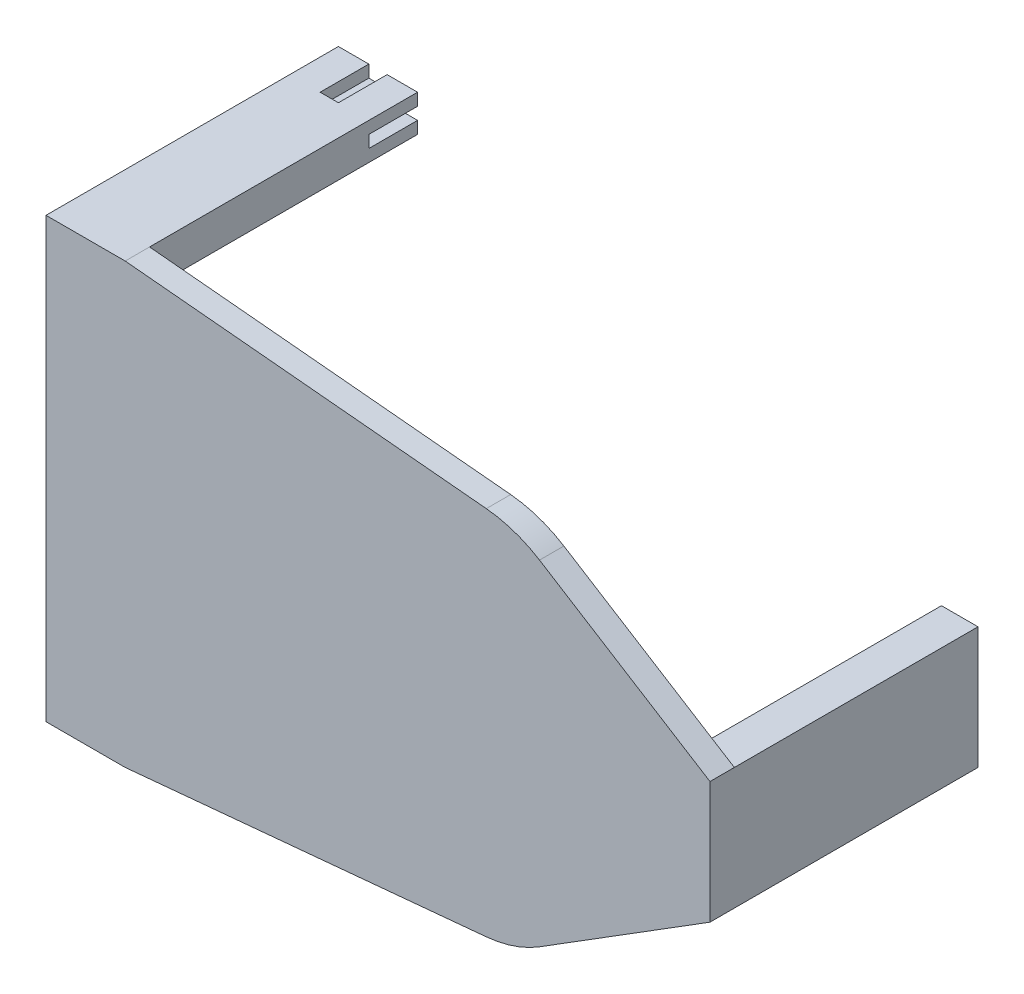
ISO-10303-21;
HEADER;
FILE_DESCRIPTION(('STEP AP214'),'2;1');
FILE_NAME('part.step','',(''),(''),'','','');
FILE_SCHEMA(('AUTOMOTIVE_DESIGN { 1 0 10303 214 1 1 1 1 }'));
ENDSEC;
DATA;
#1=APPLICATION_CONTEXT('core data for automotive mechanical design processes');
#2=APPLICATION_PROTOCOL_DEFINITION('international standard','automotive_design',2000,#1);
#3=PRODUCT_CONTEXT('',#1,'mechanical');
#4=PRODUCT('Part','Part','',(#3));
#5=PRODUCT_RELATED_PRODUCT_CATEGORY('part','',(#4));
#6=PRODUCT_DEFINITION_FORMATION('','',#4);
#7=PRODUCT_DEFINITION_CONTEXT('part definition',#1,'design');
#8=PRODUCT_DEFINITION('design','',#6,#7);
#9=PRODUCT_DEFINITION_SHAPE('','',#8);
#10=(LENGTH_UNIT() NAMED_UNIT(*) SI_UNIT(.MILLI.,.METRE.));
#11=(NAMED_UNIT(*) PLANE_ANGLE_UNIT() SI_UNIT($,.RADIAN.));
#12=(NAMED_UNIT(*) SI_UNIT($,.STERADIAN.) SOLID_ANGLE_UNIT());
#13=UNCERTAINTY_MEASURE_WITH_UNIT(LENGTH_MEASURE(1.E-05),#10,'distance_accuracy_value','');
#14=(GEOMETRIC_REPRESENTATION_CONTEXT(3) GLOBAL_UNCERTAINTY_ASSIGNED_CONTEXT((#13)) GLOBAL_UNIT_ASSIGNED_CONTEXT((#10,
#11,#12)) REPRESENTATION_CONTEXT('',''));
#15=CARTESIAN_POINT('',(0.,0.,0.));
#16=DIRECTION('',(0.,0.,1.));
#17=DIRECTION('',(1.,0.,0.));
#18=AXIS2_PLACEMENT_3D('',#15,#16,#17);
#19=CARTESIAN_POINT('',(-12.75,15.,-18.));
#20=DIRECTION('',(1.,0.,0.));
#21=DIRECTION('',(0.,0.,-1.));
#22=AXIS2_PLACEMENT_3D('',#19,#20,#21);
#23=PLANE('',#22);
#24=DIRECTION('',(0.,0.,1.));
#25=VECTOR('',#24,1.);
#26=CARTESIAN_POINT('',(-12.75,18.,-18.));
#27=LINE('',#26,#25);
#28=CARTESIAN_POINT('',(-12.75,18.,-22.));
#29=VERTEX_POINT('',#28);
#30=CARTESIAN_POINT('',(-12.75,18.,0.));
#31=VERTEX_POINT('',#30);
#32=EDGE_CURVE('E417',#29,#31,#27,.T.);
#33=ORIENTED_EDGE('',*,*,#32,.T.);
#34=DIRECTION('',(0.,-1.,0.));
#35=VECTOR('',#34,1.);
#36=CARTESIAN_POINT('',(-12.75,15.,0.));
#37=LINE('',#36,#35);
#38=CARTESIAN_POINT('',(-12.75,15.,0.));
#39=VERTEX_POINT('',#38);
#40=EDGE_CURVE('E471',#31,#39,#37,.T.);
#41=ORIENTED_EDGE('',*,*,#40,.T.);
#42=DIRECTION('',(0.,0.,1.));
#43=VECTOR('',#42,1.);
#44=CARTESIAN_POINT('',(-12.75,15.,-18.));
#45=LINE('',#44,#43);
#46=CARTESIAN_POINT('',(-12.75,15.,-22.));
#47=VERTEX_POINT('',#46);
#48=EDGE_CURVE('E420',#47,#39,#45,.T.);
#49=ORIENTED_EDGE('',*,*,#48,.F.);
#50=DIRECTION('',(0.,-1.,0.));
#51=VECTOR('',#50,1.);
#52=CARTESIAN_POINT('',(-12.75,0.,-22.));
#53=LINE('',#52,#51);
#54=CARTESIAN_POINT('',(-12.75,16.,-22.));
#55=VERTEX_POINT('',#54);
#56=EDGE_CURVE('E687',#55,#47,#53,.T.);
#57=ORIENTED_EDGE('',*,*,#56,.F.);
#58=DIRECTION('',(0.,0.,1.));
#59=VECTOR('',#58,1.);
#60=CARTESIAN_POINT('',(-12.75,16.,-22.));
#61=LINE('',#60,#59);
#62=CARTESIAN_POINT('',(-12.75,16.,-18.));
#63=VERTEX_POINT('',#62);
#64=EDGE_CURVE('E723',#55,#63,#61,.T.);
#65=ORIENTED_EDGE('',*,*,#64,.T.);
#66=DIRECTION('',(0.,1.,0.));
#67=VECTOR('',#66,1.);
#68=CARTESIAN_POINT('',(-12.75,15.,-18.));
#69=LINE('',#68,#67);
#70=CARTESIAN_POINT('',(-12.75,17.,-18.));
#71=VERTEX_POINT('',#70);
#72=EDGE_CURVE('E404',#63,#71,#69,.T.);
#73=ORIENTED_EDGE('',*,*,#72,.T.);
#74=DIRECTION('',(0.,0.,1.));
#75=VECTOR('',#74,1.);
#76=CARTESIAN_POINT('',(-12.75,17.,-22.));
#77=LINE('',#76,#75);
#78=CARTESIAN_POINT('',(-12.75,17.,-22.));
#79=VERTEX_POINT('',#78);
#80=EDGE_CURVE('E731',#79,#71,#77,.T.);
#81=ORIENTED_EDGE('',*,*,#80,.F.);
#82=DIRECTION('',(0.,-1.,0.));
#83=VECTOR('',#82,1.);
#84=CARTESIAN_POINT('',(-12.75,0.,-22.));
#85=LINE('',#84,#83);
#86=EDGE_CURVE('E678',#29,#79,#85,.T.);
#87=ORIENTED_EDGE('',*,*,#86,.F.);
#88=EDGE_LOOP('',(#33,#41,#49,#57,#65,#73,#81,#87));
#89=FACE_BOUND('',#88,.T.);
#90=ADVANCED_FACE('F36',(#89),#23,.T.);
#91=CARTESIAN_POINT('',(0.,0.,0.));
#92=DIRECTION('',(0.,0.,1.));
#93=DIRECTION('',(1.,0.,0.));
#94=AXIS2_PLACEMENT_3D('',#91,#92,#93);
#95=PLANE('',#94);
#96=DIRECTION('',(-0.847998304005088,-0.52999894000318,0.));
#97=VECTOR('',#96,1.);
#98=CARTESIAN_POINT('',(12.1488764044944,-19.438202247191,0.));
#99=LINE('',#98,#97);
#100=CARTESIAN_POINT('',(35.25,-5.,0.));
#101=VERTEX_POINT('',#100);
#102=CARTESIAN_POINT('',(21.2584557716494,-13.7447151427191,0.));
#103=VERTEX_POINT('',#102);
#104=EDGE_CURVE('E416',#101,#103,#99,.T.);
#105=ORIENTED_EDGE('',*,*,#104,.T.);
#106=CARTESIAN_POINT('',(15.9584663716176,-5.26473210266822,0.));
#107=DIRECTION('',(0.,0.,1.));
#108=DIRECTION('',(1.,0.,0.));
#109=AXIS2_PLACEMENT_3D('',#106,#107,#108);
#110=CIRCLE('',#109,10.);
#111=CARTESIAN_POINT('',(16.8918734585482,-15.2210743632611,0.));
#112=VERTEX_POINT('',#111);
#113=EDGE_CURVE('E371',#103,#112,#110,.F.);
#114=ORIENTED_EDGE('',*,*,#113,.T.);
#115=DIRECTION('',(0.995634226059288,0.0933407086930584,0.));
#116=VECTOR('',#115,1.);
#117=CARTESIAN_POINT('',(19.25,-15.,0.));
#118=LINE('',#117,#116);
#119=CARTESIAN_POINT('',(-12.75,-18.,0.));
#120=VERTEX_POINT('',#119);
#121=EDGE_CURVE('E355',#120,#112,#118,.T.);
#122=ORIENTED_EDGE('',*,*,#121,.F.);
#123=DIRECTION('',(0.,-1.,0.));
#124=VECTOR('',#123,1.);
#125=CARTESIAN_POINT('',(-12.75,-18.,0.));
#126=LINE('',#125,#124);
#127=CARTESIAN_POINT('',(-12.75,-15.,0.));
#128=VERTEX_POINT('',#127);
#129=EDGE_CURVE('E369',#128,#120,#126,.T.);
#130=ORIENTED_EDGE('',*,*,#129,.F.);
#131=DIRECTION('',(-1.,0.,0.));
#132=VECTOR('',#131,1.);
#133=CARTESIAN_POINT('',(0.,-15.,0.));
#134=LINE('',#133,#132);
#135=CARTESIAN_POINT('',(-19.25,-15.,0.));
#136=VERTEX_POINT('',#135);
#137=EDGE_CURVE('E429',#128,#136,#134,.T.);
#138=ORIENTED_EDGE('',*,*,#137,.T.);
#139=DIRECTION('',(0.,-1.,0.));
#140=VECTOR('',#139,1.);
#141=CARTESIAN_POINT('',(-19.25,0.,0.));
#142=LINE('',#141,#140);
#143=CARTESIAN_POINT('',(-19.25,15.,0.));
#144=VERTEX_POINT('',#143);
#145=EDGE_CURVE('E442',#144,#136,#142,.T.);
#146=ORIENTED_EDGE('',*,*,#145,.F.);
#147=DIRECTION('',(-1.,0.,0.));
#148=VECTOR('',#147,1.);
#149=CARTESIAN_POINT('',(0.,15.,0.));
#150=LINE('',#149,#148);
#151=EDGE_CURVE('E440',#39,#144,#150,.T.);
#152=ORIENTED_EDGE('',*,*,#151,.F.);
#153=ORIENTED_EDGE('',*,*,#40,.F.);
#154=DIRECTION('',(-0.995634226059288,0.0933407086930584,0.));
#155=VECTOR('',#154,1.);
#156=CARTESIAN_POINT('',(-12.75,18.,0.));
#157=LINE('',#156,#155);
#158=CARTESIAN_POINT('',(16.8918734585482,15.2210743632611,0.));
#159=VERTEX_POINT('',#158);
#160=EDGE_CURVE('E467',#159,#31,#157,.T.);
#161=ORIENTED_EDGE('',*,*,#160,.F.);
#162=CARTESIAN_POINT('',(15.9584663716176,5.26473210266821,0.));
#163=DIRECTION('',(0.,0.,1.));
#164=DIRECTION('',(1.,0.,0.));
#165=AXIS2_PLACEMENT_3D('',#162,#163,#164);
#166=CIRCLE('',#165,10.);
#167=CARTESIAN_POINT('',(21.2584557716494,13.7447151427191,0.));
#168=VERTEX_POINT('',#167);
#169=EDGE_CURVE('E454',#159,#168,#166,.F.);
#170=ORIENTED_EDGE('',*,*,#169,.T.);
#171=DIRECTION('',(0.847998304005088,-0.52999894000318,0.));
#172=VECTOR('',#171,1.);
#173=CARTESIAN_POINT('',(12.1488764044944,19.438202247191,0.));
#174=LINE('',#173,#172);
#175=CARTESIAN_POINT('',(35.25,4.99999999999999,0.));
#176=VERTEX_POINT('',#175);
#177=EDGE_CURVE('E438',#168,#176,#174,.T.);
#178=ORIENTED_EDGE('',*,*,#177,.T.);
#179=DIRECTION('',(1.,0.,0.));
#180=VECTOR('',#179,1.);
#181=CARTESIAN_POINT('',(35.25,4.99999999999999,0.));
#182=LINE('',#181,#180);
#183=CARTESIAN_POINT('',(32.25,4.99999999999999,0.));
#184=VERTEX_POINT('',#183);
#185=EDGE_CURVE('E496',#184,#176,#182,.T.);
#186=ORIENTED_EDGE('',*,*,#185,.F.);
#187=DIRECTION('',(0.,1.,0.));
#188=VECTOR('',#187,1.);
#189=CARTESIAN_POINT('',(32.25,-5.,0.));
#190=LINE('',#189,#188);
#191=CARTESIAN_POINT('',(32.25,-5.,0.));
#192=VERTEX_POINT('',#191);
#193=EDGE_CURVE('E505',#192,#184,#190,.T.);
#194=ORIENTED_EDGE('',*,*,#193,.F.);
#195=DIRECTION('',(-1.,0.,0.));
#196=VECTOR('',#195,1.);
#197=CARTESIAN_POINT('',(35.25,-5.,0.));
#198=LINE('',#197,#196);
#199=EDGE_CURVE('E483',#101,#192,#198,.T.);
#200=ORIENTED_EDGE('',*,*,#199,.F.);
#201=EDGE_LOOP('',(#105,#114,#122,#130,#138,#146,#152,#153,#161,#170,#178,#186,#194,#200));
#202=FACE_BOUND('',#201,.T.);
#203=ADVANCED_FACE('F368',(#202),#95,.F.);
#204=CARTESIAN_POINT('',(0.,0.,-18.));
#205=DIRECTION('',(0.,0.,-1.));
#206=DIRECTION('',(-1.,0.,0.));
#207=AXIS2_PLACEMENT_3D('',#204,#205,#206);
#208=PLANE('',#207);
#209=DIRECTION('',(1.,0.,0.));
#210=VECTOR('',#209,1.);
#211=CARTESIAN_POINT('',(0.,-16.,-18.));
#212=LINE('',#211,#210);
#213=CARTESIAN_POINT('',(-14.75,-16.,-18.));
#214=VERTEX_POINT('',#213);
#215=CARTESIAN_POINT('',(-12.75,-16.,-18.));
#216=VERTEX_POINT('',#215);
#217=EDGE_CURVE('E576',#214,#216,#212,.T.);
#218=ORIENTED_EDGE('',*,*,#217,.T.);
#219=DIRECTION('',(0.,1.,0.));
#220=VECTOR('',#219,1.);
#221=CARTESIAN_POINT('',(-12.75,-15.,-18.));
#222=LINE('',#221,#220);
#223=CARTESIAN_POINT('',(-12.75,-17.,-18.));
#224=VERTEX_POINT('',#223);
#225=EDGE_CURVE('E397',#224,#216,#222,.T.);
#226=ORIENTED_EDGE('',*,*,#225,.F.);
#227=DIRECTION('',(1.,0.,0.));
#228=VECTOR('',#227,1.);
#229=CARTESIAN_POINT('',(0.,-17.,-18.));
#230=LINE('',#229,#228);
#231=CARTESIAN_POINT('',(-14.75,-17.,-18.));
#232=VERTEX_POINT('',#231);
#233=EDGE_CURVE('E582',#232,#224,#230,.T.);
#234=ORIENTED_EDGE('',*,*,#233,.F.);
#235=DIRECTION('',(0.,1.,0.));
#236=VECTOR('',#235,1.);
#237=CARTESIAN_POINT('',(-14.75,0.,-18.));
#238=LINE('',#237,#236);
#239=EDGE_CURVE('E579',#232,#214,#238,.T.);
#240=ORIENTED_EDGE('',*,*,#239,.T.);
#241=EDGE_LOOP('',(#218,#226,#234,#240));
#242=FACE_BOUND('',#241,.T.);
#243=ADVANCED_FACE('F823',(#242),#208,.T.);
#244=DIRECTION('',(0.,1.,0.));
#245=VECTOR('',#244,1.);
#246=CARTESIAN_POINT('',(-17.25,0.,-18.));
#247=LINE('',#246,#245);
#248=CARTESIAN_POINT('',(-17.25,-17.,-18.));
#249=VERTEX_POINT('',#248);
#250=CARTESIAN_POINT('',(-17.25,-16.,-18.));
#251=VERTEX_POINT('',#250);
#252=EDGE_CURVE('E596',#249,#251,#247,.T.);
#253=ORIENTED_EDGE('',*,*,#252,.F.);
#254=DIRECTION('',(1.,0.,0.));
#255=VECTOR('',#254,1.);
#256=CARTESIAN_POINT('',(0.,-17.,-18.));
#257=LINE('',#256,#255);
#258=CARTESIAN_POINT('',(-19.25,-17.,-18.));
#259=VERTEX_POINT('',#258);
#260=EDGE_CURVE('E594',#259,#249,#257,.T.);
#261=ORIENTED_EDGE('',*,*,#260,.F.);
#262=DIRECTION('',(0.,-1.,0.));
#263=VECTOR('',#262,1.);
#264=CARTESIAN_POINT('',(-19.25,-15.,-18.));
#265=LINE('',#264,#263);
#266=CARTESIAN_POINT('',(-19.25,-16.,-18.));
#267=VERTEX_POINT('',#266);
#268=EDGE_CURVE('E762',#267,#259,#265,.T.);
#269=ORIENTED_EDGE('',*,*,#268,.F.);
#270=DIRECTION('',(1.,0.,0.));
#271=VECTOR('',#270,1.);
#272=CARTESIAN_POINT('',(0.,-16.,-18.));
#273=LINE('',#272,#271);
#274=EDGE_CURVE('E599',#267,#251,#273,.T.);
#275=ORIENTED_EDGE('',*,*,#274,.T.);
#276=EDGE_LOOP('',(#253,#261,#269,#275));
#277=FACE_BOUND('',#276,.T.);
#278=ADVANCED_FACE('F951',(#277),#208,.T.);
#279=DIRECTION('',(-1.,0.,0.));
#280=VECTOR('',#279,1.);
#281=CARTESIAN_POINT('',(-19.25,-15.,-18.));
#282=LINE('',#281,#280);
#283=CARTESIAN_POINT('',(-15.25,-15.,-18.));
#284=VERTEX_POINT('',#283);
#285=CARTESIAN_POINT('',(-16.75,-15.,-18.));
#286=VERTEX_POINT('',#285);
#287=EDGE_CURVE('E759',#284,#286,#282,.T.);
#288=ORIENTED_EDGE('',*,*,#287,.F.);
#289=DIRECTION('',(0.,1.,0.));
#290=VECTOR('',#289,1.);
#291=CARTESIAN_POINT('',(-15.25,0.,-18.));
#292=LINE('',#291,#290);
#293=CARTESIAN_POINT('',(-15.25,-16.,-18.));
#294=VERTEX_POINT('',#293);
#295=EDGE_CURVE('E521',#294,#284,#292,.T.);
#296=ORIENTED_EDGE('',*,*,#295,.F.);
#297=DIRECTION('',(1.,0.,0.));
#298=VECTOR('',#297,1.);
#299=CARTESIAN_POINT('',(0.,-16.,-18.));
#300=LINE('',#299,#298);
#301=CARTESIAN_POINT('',(-16.75,-16.,-18.));
#302=VERTEX_POINT('',#301);
#303=EDGE_CURVE('E525',#302,#294,#300,.T.);
#304=ORIENTED_EDGE('',*,*,#303,.F.);
#305=DIRECTION('',(0.,1.,0.));
#306=VECTOR('',#305,1.);
#307=CARTESIAN_POINT('',(-16.75,0.,-18.));
#308=LINE('',#307,#306);
#309=EDGE_CURVE('E602',#302,#286,#308,.T.);
#310=ORIENTED_EDGE('',*,*,#309,.T.);
#311=EDGE_LOOP('',(#288,#296,#304,#310));
#312=FACE_BOUND('',#311,.T.);
#313=ADVANCED_FACE('F805',(#312),#208,.T.);
#314=CARTESIAN_POINT('',(0.,0.,-18.));
#315=DIRECTION('',(0.,0.,-1.));
#316=DIRECTION('',(-1.,0.,0.));
#317=AXIS2_PLACEMENT_3D('',#314,#315,#316);
#318=PLANE('',#317);
#319=DIRECTION('',(0.,-1.,0.));
#320=VECTOR('',#319,1.);
#321=CARTESIAN_POINT('',(-17.25,0.,-18.));
#322=LINE('',#321,#320);
#323=CARTESIAN_POINT('',(-17.25,17.,-18.));
#324=VERTEX_POINT('',#323);
#325=CARTESIAN_POINT('',(-17.25,16.,-18.));
#326=VERTEX_POINT('',#325);
#327=EDGE_CURVE('E703',#324,#326,#322,.T.);
#328=ORIENTED_EDGE('',*,*,#327,.T.);
#329=DIRECTION('',(1.,0.,0.));
#330=VECTOR('',#329,1.);
#331=CARTESIAN_POINT('',(0.,16.,-18.));
#332=LINE('',#331,#330);
#333=CARTESIAN_POINT('',(-19.25,16.,-18.));
#334=VERTEX_POINT('',#333);
#335=EDGE_CURVE('E700',#334,#326,#332,.T.);
#336=ORIENTED_EDGE('',*,*,#335,.F.);
#337=DIRECTION('',(0.,-1.,0.));
#338=VECTOR('',#337,1.);
#339=CARTESIAN_POINT('',(-19.25,15.,-18.));
#340=LINE('',#339,#338);
#341=CARTESIAN_POINT('',(-19.25,17.,-18.));
#342=VERTEX_POINT('',#341);
#343=EDGE_CURVE('E398',#342,#334,#340,.T.);
#344=ORIENTED_EDGE('',*,*,#343,.F.);
#345=DIRECTION('',(1.,0.,0.));
#346=VECTOR('',#345,1.);
#347=CARTESIAN_POINT('',(0.,17.,-18.));
#348=LINE('',#347,#346);
#349=EDGE_CURVE('E706',#342,#324,#348,.T.);
#350=ORIENTED_EDGE('',*,*,#349,.T.);
#351=EDGE_LOOP('',(#328,#336,#344,#350));
#352=FACE_BOUND('',#351,.T.);
#353=ADVANCED_FACE('F953',(#352),#318,.T.);
#354=DIRECTION('',(0.,-1.,0.));
#355=VECTOR('',#354,1.);
#356=CARTESIAN_POINT('',(-15.25,0.,-18.));
#357=LINE('',#356,#355);
#358=CARTESIAN_POINT('',(-15.25,16.,-18.));
#359=VERTEX_POINT('',#358);
#360=CARTESIAN_POINT('',(-15.25,15.,-18.));
#361=VERTEX_POINT('',#360);
#362=EDGE_CURVE('E640',#359,#361,#357,.T.);
#363=ORIENTED_EDGE('',*,*,#362,.T.);
#364=DIRECTION('',(1.,0.,0.));
#365=VECTOR('',#364,1.);
#366=CARTESIAN_POINT('',(-19.25,15.,-18.));
#367=LINE('',#366,#365);
#368=CARTESIAN_POINT('',(-16.75,15.,-18.));
#369=VERTEX_POINT('',#368);
#370=EDGE_CURVE('E401',#369,#361,#367,.T.);
#371=ORIENTED_EDGE('',*,*,#370,.F.);
#372=DIRECTION('',(0.,-1.,0.));
#373=VECTOR('',#372,1.);
#374=CARTESIAN_POINT('',(-16.75,0.,-18.));
#375=LINE('',#374,#373);
#376=CARTESIAN_POINT('',(-16.75,16.,-18.));
#377=VERTEX_POINT('',#376);
#378=EDGE_CURVE('E698',#377,#369,#375,.T.);
#379=ORIENTED_EDGE('',*,*,#378,.F.);
#380=DIRECTION('',(1.,0.,0.));
#381=VECTOR('',#380,1.);
#382=CARTESIAN_POINT('',(0.,16.,-18.));
#383=LINE('',#382,#381);
#384=EDGE_CURVE('E695',#377,#359,#383,.T.);
#385=ORIENTED_EDGE('',*,*,#384,.T.);
#386=EDGE_LOOP('',(#363,#371,#379,#385));
#387=FACE_BOUND('',#386,.T.);
#388=ADVANCED_FACE('F958',(#387),#318,.T.);
#389=DIRECTION('',(0.,1.,0.));
#390=VECTOR('',#389,1.);
#391=CARTESIAN_POINT('',(-16.75,0.,-18.));
#392=LINE('',#391,#390);
#393=CARTESIAN_POINT('',(-16.75,17.,-18.));
#394=VERTEX_POINT('',#393);
#395=CARTESIAN_POINT('',(-16.75,18.,-18.));
#396=VERTEX_POINT('',#395);
#397=EDGE_CURVE('E709',#394,#396,#392,.T.);
#398=ORIENTED_EDGE('',*,*,#397,.T.);
#399=DIRECTION('',(-1.,0.,0.));
#400=VECTOR('',#399,1.);
#401=CARTESIAN_POINT('',(-19.25,18.,-18.));
#402=LINE('',#401,#400);
#403=CARTESIAN_POINT('',(-15.25,18.,-18.));
#404=VERTEX_POINT('',#403);
#405=EDGE_CURVE('E407',#404,#396,#402,.T.);
#406=ORIENTED_EDGE('',*,*,#405,.F.);
#407=DIRECTION('',(0.,1.,0.));
#408=VECTOR('',#407,1.);
#409=CARTESIAN_POINT('',(-15.25,0.,-18.));
#410=LINE('',#409,#408);
#411=CARTESIAN_POINT('',(-15.25,17.,-18.));
#412=VERTEX_POINT('',#411);
#413=EDGE_CURVE('E714',#412,#404,#410,.T.);
#414=ORIENTED_EDGE('',*,*,#413,.F.);
#415=DIRECTION('',(1.,0.,0.));
#416=VECTOR('',#415,1.);
#417=CARTESIAN_POINT('',(0.,17.,-18.));
#418=LINE('',#417,#416);
#419=EDGE_CURVE('E712',#394,#412,#418,.T.);
#420=ORIENTED_EDGE('',*,*,#419,.F.);
#421=EDGE_LOOP('',(#398,#406,#414,#420));
#422=FACE_BOUND('',#421,.T.);
#423=ADVANCED_FACE('F873',(#422),#318,.T.);
#424=CARTESIAN_POINT('',(12.1488764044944,-19.438202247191,2.));
#425=DIRECTION('',(0.52999894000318,-0.847998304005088,0.));
#426=DIRECTION('',(0.847998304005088,0.52999894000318,0.));
#427=AXIS2_PLACEMENT_3D('',#424,#425,#426);
#428=PLANE('',#427);
#429=DIRECTION('',(-0.847998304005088,-0.52999894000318,0.));
#430=VECTOR('',#429,1.);
#431=CARTESIAN_POINT('',(12.1488764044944,-19.438202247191,2.));
#432=LINE('',#431,#430);
#433=CARTESIAN_POINT('',(35.25,-5.,2.));
#434=VERTEX_POINT('',#433);
#435=CARTESIAN_POINT('',(21.2584557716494,-13.7447151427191,2.));
#436=VERTEX_POINT('',#435);
#437=EDGE_CURVE('E425',#434,#436,#432,.T.);
#438=ORIENTED_EDGE('',*,*,#437,.T.);
#439=DIRECTION('',(0.,0.,-1.));
#440=VECTOR('',#439,1.);
#441=CARTESIAN_POINT('',(21.2584557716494,-13.7447151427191,2.));
#442=LINE('',#441,#440);
#443=EDGE_CURVE('E451',#436,#103,#442,.T.);
#444=ORIENTED_EDGE('',*,*,#443,.T.);
#445=ORIENTED_EDGE('',*,*,#104,.F.);
#446=DIRECTION('',(0.,0.,-1.));
#447=VECTOR('',#446,1.);
#448=CARTESIAN_POINT('',(35.25,-5.,2.));
#449=LINE('',#448,#447);
#450=EDGE_CURVE('E448',#434,#101,#449,.T.);
#451=ORIENTED_EDGE('',*,*,#450,.F.);
#452=EDGE_LOOP('',(#438,#444,#445,#451));
#453=FACE_BOUND('',#452,.T.);
#454=ADVANCED_FACE('F870',(#453),#428,.T.);
#455=CARTESIAN_POINT('',(35.25,0.,2.));
#456=DIRECTION('',(1.,0.,0.));
#457=DIRECTION('',(0.,0.,-1.));
#458=AXIS2_PLACEMENT_3D('',#455,#456,#457);
#459=PLANE('',#458);
#460=ORIENTED_EDGE('',*,*,#450,.T.);
#461=DIRECTION('',(0.,0.,1.));
#462=VECTOR('',#461,1.);
#463=CARTESIAN_POINT('',(35.25,-5.,-20.));
#464=LINE('',#463,#462);
#465=CARTESIAN_POINT('',(35.25,-5.,-20.));
#466=VERTEX_POINT('',#465);
#467=EDGE_CURVE('E518',#466,#101,#464,.T.);
#468=ORIENTED_EDGE('',*,*,#467,.F.);
#469=DIRECTION('',(0.,-1.,0.));
#470=VECTOR('',#469,1.);
#471=CARTESIAN_POINT('',(35.25,-5.,-20.));
#472=LINE('',#471,#470);
#473=CARTESIAN_POINT('',(35.25,4.99999999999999,-20.));
#474=VERTEX_POINT('',#473);
#475=EDGE_CURVE('E492',#474,#466,#472,.T.);
#476=ORIENTED_EDGE('',*,*,#475,.F.);
#477=DIRECTION('',(0.,0.,1.));
#478=VECTOR('',#477,1.);
#479=CARTESIAN_POINT('',(35.25,4.99999999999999,-20.));
#480=LINE('',#479,#478);
#481=EDGE_CURVE('E502',#474,#176,#480,.T.);
#482=ORIENTED_EDGE('',*,*,#481,.T.);
#483=DIRECTION('',(0.,0.,-1.));
#484=VECTOR('',#483,1.);
#485=CARTESIAN_POINT('',(35.25,5.,2.));
#486=LINE('',#485,#484);
#487=CARTESIAN_POINT('',(35.25,5.,2.));
#488=VERTEX_POINT('',#487);
#489=EDGE_CURVE('E436',#488,#176,#486,.T.);
#490=ORIENTED_EDGE('',*,*,#489,.F.);
#491=DIRECTION('',(0.,-1.,0.));
#492=VECTOR('',#491,1.);
#493=CARTESIAN_POINT('',(35.25,0.,2.));
#494=LINE('',#493,#492);
#495=EDGE_CURVE('E428',#488,#434,#494,.T.);
#496=ORIENTED_EDGE('',*,*,#495,.T.);
#497=EDGE_LOOP('',(#460,#468,#476,#482,#490,#496));
#498=FACE_BOUND('',#497,.T.);
#499=ADVANCED_FACE('F867',(#498),#459,.T.);
#500=CARTESIAN_POINT('',(12.1488764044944,19.438202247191,2.));
#501=DIRECTION('',(0.52999894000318,0.847998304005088,0.));
#502=DIRECTION('',(-0.847998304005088,0.52999894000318,0.));
#503=AXIS2_PLACEMENT_3D('',#500,#501,#502);
#504=PLANE('',#503);
#505=ORIENTED_EDGE('',*,*,#177,.F.);
#506=DIRECTION('',(0.,0.,-1.));
#507=VECTOR('',#506,1.);
#508=CARTESIAN_POINT('',(21.2584557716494,13.7447151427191,2.));
#509=LINE('',#508,#507);
#510=CARTESIAN_POINT('',(21.2584557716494,13.7447151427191,2.));
#511=VERTEX_POINT('',#510);
#512=EDGE_CURVE('E11',#168,#511,#509,.F.);
#513=ORIENTED_EDGE('',*,*,#512,.T.);
#514=DIRECTION('',(0.847998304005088,-0.52999894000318,0.));
#515=VECTOR('',#514,1.);
#516=CARTESIAN_POINT('',(12.1488764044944,19.438202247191,2.));
#517=LINE('',#516,#515);
#518=EDGE_CURVE('E432',#511,#488,#517,.T.);
#519=ORIENTED_EDGE('',*,*,#518,.T.);
#520=ORIENTED_EDGE('',*,*,#489,.T.);
#521=EDGE_LOOP('',(#505,#513,#519,#520));
#522=FACE_BOUND('',#521,.T.);
#523=ADVANCED_FACE('F864',(#522),#504,.T.);
#524=CARTESIAN_POINT('',(-19.25,0.,2.));
#525=DIRECTION('',(1.,0.,0.));
#526=DIRECTION('',(0.,0.,-1.));
#527=AXIS2_PLACEMENT_3D('',#524,#525,#526);
#528=PLANE('',#527);
#529=ORIENTED_EDGE('',*,*,#145,.T.);
#530=DIRECTION('',(0.,0.,1.));
#531=VECTOR('',#530,1.);
#532=CARTESIAN_POINT('',(-19.25,-15.,-18.));
#533=LINE('',#532,#531);
#534=CARTESIAN_POINT('',(-19.25,-15.,-22.));
#535=VERTEX_POINT('',#534);
#536=EDGE_CURVE('E391',#535,#136,#533,.T.);
#537=ORIENTED_EDGE('',*,*,#536,.F.);
#538=DIRECTION('',(0.,-1.,0.));
#539=VECTOR('',#538,1.);
#540=CARTESIAN_POINT('',(-19.25,0.,-22.));
#541=LINE('',#540,#539);
#542=CARTESIAN_POINT('',(-19.25,-16.,-22.));
#543=VERTEX_POINT('',#542);
#544=EDGE_CURVE('E562',#535,#543,#541,.T.);
#545=ORIENTED_EDGE('',*,*,#544,.T.);
#546=DIRECTION('',(0.,0.,1.));
#547=VECTOR('',#546,1.);
#548=CARTESIAN_POINT('',(-19.25,-16.,-22.));
#549=LINE('',#548,#547);
#550=EDGE_CURVE('E613',#543,#267,#549,.T.);
#551=ORIENTED_EDGE('',*,*,#550,.T.);
#552=ORIENTED_EDGE('',*,*,#268,.T.);
#553=DIRECTION('',(0.,0.,1.));
#554=VECTOR('',#553,1.);
#555=CARTESIAN_POINT('',(-19.25,-17.,-22.));
#556=LINE('',#555,#554);
#557=CARTESIAN_POINT('',(-19.25,-17.,-22.));
#558=VERTEX_POINT('',#557);
#559=EDGE_CURVE('E620',#558,#259,#556,.T.);
#560=ORIENTED_EDGE('',*,*,#559,.F.);
#561=DIRECTION('',(0.,-1.,0.));
#562=VECTOR('',#561,1.);
#563=CARTESIAN_POINT('',(-19.25,0.,-22.));
#564=LINE('',#563,#562);
#565=CARTESIAN_POINT('',(-19.25,-18.,-22.));
#566=VERTEX_POINT('',#565);
#567=EDGE_CURVE('E552',#558,#566,#564,.T.);
#568=ORIENTED_EDGE('',*,*,#567,.T.);
#569=DIRECTION('',(0.,0.,1.));
#570=VECTOR('',#569,1.);
#571=CARTESIAN_POINT('',(-19.25,-18.,-18.));
#572=LINE('',#571,#570);
#573=CARTESIAN_POINT('',(-19.25,-18.,2.));
#574=VERTEX_POINT('',#573);
#575=EDGE_CURVE('E386',#566,#574,#572,.T.);
#576=ORIENTED_EDGE('',*,*,#575,.T.);
#577=DIRECTION('',(0.,-1.,0.));
#578=VECTOR('',#577,1.);
#579=CARTESIAN_POINT('',(-19.25,0.,2.));
#580=LINE('',#579,#578);
#581=CARTESIAN_POINT('',(-19.25,18.,2.));
#582=VERTEX_POINT('',#581);
#583=EDGE_CURVE('E434',#582,#574,#580,.T.);
#584=ORIENTED_EDGE('',*,*,#583,.F.);
#585=DIRECTION('',(0.,0.,1.));
#586=VECTOR('',#585,1.);
#587=CARTESIAN_POINT('',(-19.25,18.,-18.));
#588=LINE('',#587,#586);
#589=CARTESIAN_POINT('',(-19.25,18.,-22.));
#590=VERTEX_POINT('',#589);
#591=EDGE_CURVE('E413',#590,#582,#588,.T.);
#592=ORIENTED_EDGE('',*,*,#591,.F.);
#593=DIRECTION('',(0.,1.,0.));
#594=VECTOR('',#593,1.);
#595=CARTESIAN_POINT('',(-19.25,0.,-22.));
#596=LINE('',#595,#594);
#597=CARTESIAN_POINT('',(-19.25,17.,-22.));
#598=VERTEX_POINT('',#597);
#599=EDGE_CURVE('E663',#598,#590,#596,.T.);
#600=ORIENTED_EDGE('',*,*,#599,.F.);
#601=DIRECTION('',(0.,0.,1.));
#602=VECTOR('',#601,1.);
#603=CARTESIAN_POINT('',(-19.25,17.,-22.));
#604=LINE('',#603,#602);
#605=EDGE_CURVE('E743',#598,#342,#604,.T.);
#606=ORIENTED_EDGE('',*,*,#605,.T.);
#607=ORIENTED_EDGE('',*,*,#343,.T.);
#608=DIRECTION('',(0.,0.,1.));
#609=VECTOR('',#608,1.);
#610=CARTESIAN_POINT('',(-19.25,16.,-22.));
#611=LINE('',#610,#609);
#612=CARTESIAN_POINT('',(-19.25,16.,-22.));
#613=VERTEX_POINT('',#612);
#614=EDGE_CURVE('E749',#613,#334,#611,.T.);
#615=ORIENTED_EDGE('',*,*,#614,.F.);
#616=DIRECTION('',(0.,1.,0.));
#617=VECTOR('',#616,1.);
#618=CARTESIAN_POINT('',(-19.25,0.,-22.));
#619=LINE('',#618,#617);
#620=CARTESIAN_POINT('',(-19.25,15.,-22.));
#621=VERTEX_POINT('',#620);
#622=EDGE_CURVE('E653',#621,#613,#619,.T.);
#623=ORIENTED_EDGE('',*,*,#622,.F.);
#624=DIRECTION('',(0.,0.,1.));
#625=VECTOR('',#624,1.);
#626=CARTESIAN_POINT('',(-19.25,15.,-18.));
#627=LINE('',#626,#625);
#628=EDGE_CURVE('E410',#621,#144,#627,.T.);
#629=ORIENTED_EDGE('',*,*,#628,.T.);
#630=EDGE_LOOP('',(#529,#537,#545,#551,#552,#560,#568,#576,#584,#592,#600,#606,#607,#615,#623,#629));
#631=FACE_BOUND('',#630,.T.);
#632=ADVANCED_FACE('F779',(#631),#528,.F.);
#633=CARTESIAN_POINT('',(0.,0.,2.));
#634=DIRECTION('',(0.,0.,1.));
#635=DIRECTION('',(1.,0.,0.));
#636=AXIS2_PLACEMENT_3D('',#633,#634,#635);
#637=PLANE('',#636);
#638=DIRECTION('',(0.995634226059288,0.0933407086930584,0.));
#639=VECTOR('',#638,1.);
#640=CARTESIAN_POINT('',(19.25,-15.,2.));
#641=LINE('',#640,#639);
#642=CARTESIAN_POINT('',(-12.75,-18.,2.));
#643=VERTEX_POINT('',#642);
#644=CARTESIAN_POINT('',(16.8918734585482,-15.2210743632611,2.));
#645=VERTEX_POINT('',#644);
#646=EDGE_CURVE('E358',#643,#645,#641,.T.);
#647=ORIENTED_EDGE('',*,*,#646,.T.);
#648=CARTESIAN_POINT('',(15.9584663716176,-5.26473210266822,2.));
#649=DIRECTION('',(0.,0.,1.));
#650=DIRECTION('',(1.,0.,0.));
#651=AXIS2_PLACEMENT_3D('',#648,#649,#650);
#652=CIRCLE('',#651,10.);
#653=EDGE_CURVE('E460',#645,#436,#652,.T.);
#654=ORIENTED_EDGE('',*,*,#653,.T.);
#655=ORIENTED_EDGE('',*,*,#437,.F.);
#656=ORIENTED_EDGE('',*,*,#495,.F.);
#657=ORIENTED_EDGE('',*,*,#518,.F.);
#658=CARTESIAN_POINT('',(15.9584663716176,5.26473210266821,2.));
#659=DIRECTION('',(0.,0.,1.));
#660=DIRECTION('',(1.,0.,0.));
#661=AXIS2_PLACEMENT_3D('',#658,#659,#660);
#662=CIRCLE('',#661,10.);
#663=CARTESIAN_POINT('',(16.8918734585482,15.2210743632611,2.));
#664=VERTEX_POINT('',#663);
#665=EDGE_CURVE('E51',#511,#664,#662,.T.);
#666=ORIENTED_EDGE('',*,*,#665,.T.);
#667=DIRECTION('',(-0.995634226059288,0.0933407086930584,0.));
#668=VECTOR('',#667,1.);
#669=CARTESIAN_POINT('',(-12.75,18.,2.));
#670=LINE('',#669,#668);
#671=CARTESIAN_POINT('',(-12.75,18.,2.));
#672=VERTEX_POINT('',#671);
#673=EDGE_CURVE('E363',#664,#672,#670,.T.);
#674=ORIENTED_EDGE('',*,*,#673,.T.);
#675=DIRECTION('',(-1.,0.,0.));
#676=VECTOR('',#675,1.);
#677=CARTESIAN_POINT('',(-19.25,18.,2.));
#678=LINE('',#677,#676);
#679=EDGE_CURVE('E388',#672,#582,#678,.T.);
#680=ORIENTED_EDGE('',*,*,#679,.T.);
#681=ORIENTED_EDGE('',*,*,#583,.T.);
#682=DIRECTION('',(1.,0.,0.));
#683=VECTOR('',#682,1.);
#684=CARTESIAN_POINT('',(-19.25,-18.,2.));
#685=LINE('',#684,#683);
#686=EDGE_CURVE('E758',#574,#643,#685,.T.);
#687=ORIENTED_EDGE('',*,*,#686,.T.);
#688=EDGE_LOOP('',(#647,#654,#655,#656,#657,#666,#674,#680,#681,#687));
#689=FACE_BOUND('',#688,.T.);
#690=ADVANCED_FACE('F769',(#689),#637,.T.);
#691=CARTESIAN_POINT('',(-19.25,18.,-18.));
#692=DIRECTION('',(0.,1.,0.));
#693=DIRECTION('',(0.,0.,1.));
#694=AXIS2_PLACEMENT_3D('',#691,#692,#693);
#695=PLANE('',#694);
#696=ORIENTED_EDGE('',*,*,#679,.F.);
#697=DIRECTION('',(0.,0.,1.));
#698=VECTOR('',#697,1.);
#699=CARTESIAN_POINT('',(-12.75,18.,0.));
#700=LINE('',#699,#698);
#701=EDGE_CURVE('E473',#31,#672,#700,.T.);
#702=ORIENTED_EDGE('',*,*,#701,.F.);
#703=ORIENTED_EDGE('',*,*,#32,.F.);
#704=DIRECTION('',(1.,0.,0.));
#705=VECTOR('',#704,1.);
#706=CARTESIAN_POINT('',(0.,18.,-22.));
#707=LINE('',#706,#705);
#708=CARTESIAN_POINT('',(-15.25,18.,-22.));
#709=VERTEX_POINT('',#708);
#710=EDGE_CURVE('E675',#709,#29,#707,.T.);
#711=ORIENTED_EDGE('',*,*,#710,.F.);
#712=DIRECTION('',(0.,0.,1.));
#713=VECTOR('',#712,1.);
#714=CARTESIAN_POINT('',(-15.25,18.,-22.));
#715=LINE('',#714,#713);
#716=EDGE_CURVE('E733',#709,#404,#715,.T.);
#717=ORIENTED_EDGE('',*,*,#716,.T.);
#718=ORIENTED_EDGE('',*,*,#405,.T.);
#719=DIRECTION('',(0.,0.,1.));
#720=VECTOR('',#719,1.);
#721=CARTESIAN_POINT('',(-16.75,18.,-22.));
#722=LINE('',#721,#720);
#723=CARTESIAN_POINT('',(-16.75,18.,-22.));
#724=VERTEX_POINT('',#723);
#725=EDGE_CURVE('E741',#724,#396,#722,.T.);
#726=ORIENTED_EDGE('',*,*,#725,.F.);
#727=DIRECTION('',(1.,0.,0.));
#728=VECTOR('',#727,1.);
#729=CARTESIAN_POINT('',(0.,18.,-22.));
#730=LINE('',#729,#728);
#731=EDGE_CURVE('E666',#590,#724,#730,.T.);
#732=ORIENTED_EDGE('',*,*,#731,.F.);
#733=ORIENTED_EDGE('',*,*,#591,.T.);
#734=EDGE_LOOP('',(#696,#702,#703,#711,#717,#718,#726,#732,#733));
#735=FACE_BOUND('',#734,.T.);
#736=ADVANCED_FACE('F853',(#735),#695,.T.);
#737=CARTESIAN_POINT('',(-19.25,15.,-18.));
#738=DIRECTION('',(0.,-1.,0.));
#739=DIRECTION('',(0.,0.,-1.));
#740=AXIS2_PLACEMENT_3D('',#737,#738,#739);
#741=PLANE('',#740);
#742=ORIENTED_EDGE('',*,*,#48,.T.);
#743=ORIENTED_EDGE('',*,*,#151,.T.);
#744=ORIENTED_EDGE('',*,*,#628,.F.);
#745=DIRECTION('',(-1.,0.,0.));
#746=VECTOR('',#745,1.);
#747=CARTESIAN_POINT('',(0.,15.,-22.));
#748=LINE('',#747,#746);
#749=CARTESIAN_POINT('',(-16.75,15.,-22.));
#750=VERTEX_POINT('',#749);
#751=EDGE_CURVE('E650',#750,#621,#748,.T.);
#752=ORIENTED_EDGE('',*,*,#751,.F.);
#753=DIRECTION('',(0.,0.,1.));
#754=VECTOR('',#753,1.);
#755=CARTESIAN_POINT('',(-16.75,15.,-22.));
#756=LINE('',#755,#754);
#757=EDGE_CURVE('E751',#750,#369,#756,.T.);
#758=ORIENTED_EDGE('',*,*,#757,.T.);
#759=ORIENTED_EDGE('',*,*,#370,.T.);
#760=DIRECTION('',(0.,0.,1.));
#761=VECTOR('',#760,1.);
#762=CARTESIAN_POINT('',(-15.25,15.,-22.));
#763=LINE('',#762,#761);
#764=CARTESIAN_POINT('',(-15.25,15.,-22.));
#765=VERTEX_POINT('',#764);
#766=EDGE_CURVE('E692',#765,#361,#763,.T.);
#767=ORIENTED_EDGE('',*,*,#766,.F.);
#768=DIRECTION('',(-1.,0.,0.));
#769=VECTOR('',#768,1.);
#770=CARTESIAN_POINT('',(0.,15.,-22.));
#771=LINE('',#770,#769);
#772=EDGE_CURVE('E690',#47,#765,#771,.T.);
#773=ORIENTED_EDGE('',*,*,#772,.F.);
#774=EDGE_LOOP('',(#742,#743,#744,#752,#758,#759,#767,#773));
#775=FACE_BOUND('',#774,.T.);
#776=ADVANCED_FACE('F855',(#775),#741,.T.);
#777=DIRECTION('',(1.,0.,0.));
#778=VECTOR('',#777,1.);
#779=CARTESIAN_POINT('',(0.,17.,-18.));
#780=LINE('',#779,#778);
#781=CARTESIAN_POINT('',(-14.75,17.,-18.));
#782=VERTEX_POINT('',#781);
#783=EDGE_CURVE('E716',#782,#71,#780,.T.);
#784=ORIENTED_EDGE('',*,*,#783,.T.);
#785=ORIENTED_EDGE('',*,*,#72,.F.);
#786=DIRECTION('',(1.,0.,0.));
#787=VECTOR('',#786,1.);
#788=CARTESIAN_POINT('',(0.,16.,-18.));
#789=LINE('',#788,#787);
#790=CARTESIAN_POINT('',(-14.75,16.,-18.));
#791=VERTEX_POINT('',#790);
#792=EDGE_CURVE('E645',#791,#63,#789,.T.);
#793=ORIENTED_EDGE('',*,*,#792,.F.);
#794=DIRECTION('',(0.,-1.,0.));
#795=VECTOR('',#794,1.);
#796=CARTESIAN_POINT('',(-14.75,0.,-18.));
#797=LINE('',#796,#795);
#798=EDGE_CURVE('E719',#782,#791,#797,.T.);
#799=ORIENTED_EDGE('',*,*,#798,.F.);
#800=EDGE_LOOP('',(#784,#785,#793,#799));
#801=FACE_BOUND('',#800,.T.);
#802=ADVANCED_FACE('F858',(#801),#318,.T.);
#803=CARTESIAN_POINT('',(-19.25,-15.,-18.));
#804=DIRECTION('',(0.,1.,0.));
#805=DIRECTION('',(-1.,0.,0.));
#806=AXIS2_PLACEMENT_3D('',#803,#804,#805);
#807=PLANE('',#806);
#808=ORIENTED_EDGE('',*,*,#137,.F.);
#809=DIRECTION('',(0.,0.,1.));
#810=VECTOR('',#809,1.);
#811=CARTESIAN_POINT('',(-12.75,-15.,-18.));
#812=LINE('',#811,#810);
#813=CARTESIAN_POINT('',(-12.75,-15.,-22.));
#814=VERTEX_POINT('',#813);
#815=EDGE_CURVE('E380',#814,#128,#812,.T.);
#816=ORIENTED_EDGE('',*,*,#815,.F.);
#817=DIRECTION('',(-1.,0.,0.));
#818=VECTOR('',#817,1.);
#819=CARTESIAN_POINT('',(0.,-15.,-22.));
#820=LINE('',#819,#818);
#821=CARTESIAN_POINT('',(-15.25,-15.,-22.));
#822=VERTEX_POINT('',#821);
#823=EDGE_CURVE('E524',#814,#822,#820,.T.);
#824=ORIENTED_EDGE('',*,*,#823,.T.);
#825=DIRECTION('',(0.,0.,1.));
#826=VECTOR('',#825,1.);
#827=CARTESIAN_POINT('',(-15.25,-15.,-22.));
#828=LINE('',#827,#826);
#829=EDGE_CURVE('E638',#822,#284,#828,.T.);
#830=ORIENTED_EDGE('',*,*,#829,.T.);
#831=ORIENTED_EDGE('',*,*,#287,.T.);
#832=DIRECTION('',(0.,0.,1.));
#833=VECTOR('',#832,1.);
#834=CARTESIAN_POINT('',(-16.75,-15.,-22.));
#835=LINE('',#834,#833);
#836=CARTESIAN_POINT('',(-16.75,-15.,-22.));
#837=VERTEX_POINT('',#836);
#838=EDGE_CURVE('E611',#837,#286,#835,.T.);
#839=ORIENTED_EDGE('',*,*,#838,.F.);
#840=DIRECTION('',(-1.,0.,0.));
#841=VECTOR('',#840,1.);
#842=CARTESIAN_POINT('',(0.,-15.,-22.));
#843=LINE('',#842,#841);
#844=EDGE_CURVE('E565',#837,#535,#843,.T.);
#845=ORIENTED_EDGE('',*,*,#844,.T.);
#846=ORIENTED_EDGE('',*,*,#536,.T.);
#847=EDGE_LOOP('',(#808,#816,#824,#830,#831,#839,#845,#846));
#848=FACE_BOUND('',#847,.T.);
#849=ADVANCED_FACE('F799',(#848),#807,.T.);
#850=CARTESIAN_POINT('',(-12.75,-15.,-18.));
#851=DIRECTION('',(1.,0.,0.));
#852=DIRECTION('',(0.,1.,0.));
#853=AXIS2_PLACEMENT_3D('',#850,#851,#852);
#854=PLANE('',#853);
#855=ORIENTED_EDGE('',*,*,#129,.T.);
#856=DIRECTION('',(0.,0.,1.));
#857=VECTOR('',#856,1.);
#858=CARTESIAN_POINT('',(-12.75,-18.,-18.));
#859=LINE('',#858,#857);
#860=CARTESIAN_POINT('',(-12.75,-18.,-22.));
#861=VERTEX_POINT('',#860);
#862=EDGE_CURVE('E377',#861,#120,#859,.T.);
#863=ORIENTED_EDGE('',*,*,#862,.F.);
#864=DIRECTION('',(0.,1.,0.));
#865=VECTOR('',#864,1.);
#866=CARTESIAN_POINT('',(-12.75,0.,-22.));
#867=LINE('',#866,#865);
#868=CARTESIAN_POINT('',(-12.75,-17.,-22.));
#869=VERTEX_POINT('',#868);
#870=EDGE_CURVE('E538',#861,#869,#867,.T.);
#871=ORIENTED_EDGE('',*,*,#870,.T.);
#872=DIRECTION('',(0.,0.,1.));
#873=VECTOR('',#872,1.);
#874=CARTESIAN_POINT('',(-12.75,-17.,-22.));
#875=LINE('',#874,#873);
#876=EDGE_CURVE('E630',#869,#224,#875,.T.);
#877=ORIENTED_EDGE('',*,*,#876,.T.);
#878=ORIENTED_EDGE('',*,*,#225,.T.);
#879=DIRECTION('',(0.,0.,1.));
#880=VECTOR('',#879,1.);
#881=CARTESIAN_POINT('',(-12.75,-16.,-22.));
#882=LINE('',#881,#880);
#883=CARTESIAN_POINT('',(-12.75,-16.,-22.));
#884=VERTEX_POINT('',#883);
#885=EDGE_CURVE('E636',#884,#216,#882,.T.);
#886=ORIENTED_EDGE('',*,*,#885,.F.);
#887=DIRECTION('',(0.,1.,0.));
#888=VECTOR('',#887,1.);
#889=CARTESIAN_POINT('',(-12.75,0.,-22.));
#890=LINE('',#889,#888);
#891=EDGE_CURVE('E528',#884,#814,#890,.T.);
#892=ORIENTED_EDGE('',*,*,#891,.T.);
#893=ORIENTED_EDGE('',*,*,#815,.T.);
#894=EDGE_LOOP('',(#855,#863,#871,#877,#878,#886,#892,#893));
#895=FACE_BOUND('',#894,.T.);
#896=ADVANCED_FACE('F375',(#895),#854,.T.);
#897=CARTESIAN_POINT('',(-19.25,-18.,-18.));
#898=DIRECTION('',(0.,-1.,0.));
#899=DIRECTION('',(1.,0.,0.));
#900=AXIS2_PLACEMENT_3D('',#897,#898,#899);
#901=PLANE('',#900);
#902=ORIENTED_EDGE('',*,*,#686,.F.);
#903=ORIENTED_EDGE('',*,*,#575,.F.);
#904=DIRECTION('',(1.,0.,0.));
#905=VECTOR('',#904,1.);
#906=CARTESIAN_POINT('',(0.,-18.,-22.));
#907=LINE('',#906,#905);
#908=CARTESIAN_POINT('',(-16.75,-18.,-22.));
#909=VERTEX_POINT('',#908);
#910=EDGE_CURVE('E549',#566,#909,#907,.T.);
#911=ORIENTED_EDGE('',*,*,#910,.T.);
#912=DIRECTION('',(0.,0.,1.));
#913=VECTOR('',#912,1.);
#914=CARTESIAN_POINT('',(-16.75,-18.,-22.));
#915=LINE('',#914,#913);
#916=CARTESIAN_POINT('',(-16.75,-18.,-18.));
#917=VERTEX_POINT('',#916);
#918=EDGE_CURVE('E622',#909,#917,#915,.T.);
#919=ORIENTED_EDGE('',*,*,#918,.T.);
#920=DIRECTION('',(1.,0.,0.));
#921=VECTOR('',#920,1.);
#922=CARTESIAN_POINT('',(-19.25,-18.,-18.));
#923=LINE('',#922,#921);
#924=CARTESIAN_POINT('',(-15.25,-18.,-18.));
#925=VERTEX_POINT('',#924);
#926=EDGE_CURVE('E765',#917,#925,#923,.T.);
#927=ORIENTED_EDGE('',*,*,#926,.T.);
#928=DIRECTION('',(0.,0.,1.));
#929=VECTOR('',#928,1.);
#930=CARTESIAN_POINT('',(-15.25,-18.,-22.));
#931=LINE('',#930,#929);
#932=CARTESIAN_POINT('',(-15.25,-18.,-22.));
#933=VERTEX_POINT('',#932);
#934=EDGE_CURVE('E628',#933,#925,#931,.T.);
#935=ORIENTED_EDGE('',*,*,#934,.F.);
#936=DIRECTION('',(1.,0.,0.));
#937=VECTOR('',#936,1.);
#938=CARTESIAN_POINT('',(0.,-18.,-22.));
#939=LINE('',#938,#937);
#940=EDGE_CURVE('E385',#933,#861,#939,.T.);
#941=ORIENTED_EDGE('',*,*,#940,.T.);
#942=ORIENTED_EDGE('',*,*,#862,.T.);
#943=DIRECTION('',(0.,0.,1.));
#944=VECTOR('',#943,1.);
#945=CARTESIAN_POINT('',(-12.75,-18.,0.));
#946=LINE('',#945,#944);
#947=EDGE_CURVE('E352',#120,#643,#946,.T.);
#948=ORIENTED_EDGE('',*,*,#947,.T.);
#949=EDGE_LOOP('',(#902,#903,#911,#919,#927,#935,#941,#942,#948));
#950=FACE_BOUND('',#949,.T.);
#951=ADVANCED_FACE('F383',(#950),#901,.T.);
#952=DIRECTION('',(0.,-1.,0.));
#953=VECTOR('',#952,1.);
#954=CARTESIAN_POINT('',(-15.25,0.,-18.));
#955=LINE('',#954,#953);
#956=CARTESIAN_POINT('',(-15.25,-17.,-18.));
#957=VERTEX_POINT('',#956);
#958=EDGE_CURVE('E585',#957,#925,#955,.T.);
#959=ORIENTED_EDGE('',*,*,#958,.T.);
#960=ORIENTED_EDGE('',*,*,#926,.F.);
#961=DIRECTION('',(0.,-1.,0.));
#962=VECTOR('',#961,1.);
#963=CARTESIAN_POINT('',(-16.75,0.,-18.));
#964=LINE('',#963,#962);
#965=CARTESIAN_POINT('',(-16.75,-17.,-18.));
#966=VERTEX_POINT('',#965);
#967=EDGE_CURVE('E591',#966,#917,#964,.T.);
#968=ORIENTED_EDGE('',*,*,#967,.F.);
#969=DIRECTION('',(1.,0.,0.));
#970=VECTOR('',#969,1.);
#971=CARTESIAN_POINT('',(0.,-17.,-18.));
#972=LINE('',#971,#970);
#973=EDGE_CURVE('E588',#966,#957,#972,.T.);
#974=ORIENTED_EDGE('',*,*,#973,.T.);
#975=EDGE_LOOP('',(#959,#960,#968,#974));
#976=FACE_BOUND('',#975,.T.);
#977=ADVANCED_FACE('F936',(#976),#208,.T.);
#978=CARTESIAN_POINT('',(-15.25,0.,-22.));
#979=DIRECTION('',(-1.,0.,0.));
#980=DIRECTION('',(0.,0.,1.));
#981=AXIS2_PLACEMENT_3D('',#978,#979,#980);
#982=PLANE('',#981);
#983=ORIENTED_EDGE('',*,*,#362,.F.);
#984=DIRECTION('',(0.,0.,1.));
#985=VECTOR('',#984,1.);
#986=CARTESIAN_POINT('',(-15.25,16.,-22.));
#987=LINE('',#986,#985);
#988=CARTESIAN_POINT('',(-15.25,16.,-22.));
#989=VERTEX_POINT('',#988);
#990=EDGE_CURVE('E756',#989,#359,#987,.T.);
#991=ORIENTED_EDGE('',*,*,#990,.F.);
#992=DIRECTION('',(0.,-1.,0.));
#993=VECTOR('',#992,1.);
#994=CARTESIAN_POINT('',(-15.25,0.,-22.));
#995=LINE('',#994,#993);
#996=EDGE_CURVE('E641',#989,#765,#995,.T.);
#997=ORIENTED_EDGE('',*,*,#996,.T.);
#998=ORIENTED_EDGE('',*,*,#766,.T.);
#999=EDGE_LOOP('',(#983,#991,#997,#998));
#1000=FACE_BOUND('',#999,.T.);
#1001=ADVANCED_FACE('F939',(#1000),#982,.T.);
#1002=CARTESIAN_POINT('',(0.,16.,-22.));
#1003=DIRECTION('',(0.,-1.,0.));
#1004=DIRECTION('',(0.,0.,-1.));
#1005=AXIS2_PLACEMENT_3D('',#1002,#1003,#1004);
#1006=PLANE('',#1005);
#1007=ORIENTED_EDGE('',*,*,#384,.F.);
#1008=DIRECTION('',(0.,0.,1.));
#1009=VECTOR('',#1008,1.);
#1010=CARTESIAN_POINT('',(-16.75,16.,-22.));
#1011=LINE('',#1010,#1009);
#1012=CARTESIAN_POINT('',(-16.75,16.,-22.));
#1013=VERTEX_POINT('',#1012);
#1014=EDGE_CURVE('E754',#1013,#377,#1011,.T.);
#1015=ORIENTED_EDGE('',*,*,#1014,.F.);
#1016=DIRECTION('',(1.,0.,0.));
#1017=VECTOR('',#1016,1.);
#1018=CARTESIAN_POINT('',(0.,16.,-22.));
#1019=LINE('',#1018,#1017);
#1020=EDGE_CURVE('E644',#1013,#989,#1019,.T.);
#1021=ORIENTED_EDGE('',*,*,#1020,.T.);
#1022=ORIENTED_EDGE('',*,*,#990,.T.);
#1023=EDGE_LOOP('',(#1007,#1015,#1021,#1022));
#1024=FACE_BOUND('',#1023,.T.);
#1025=ADVANCED_FACE('F945',(#1024),#1006,.T.);
#1026=CARTESIAN_POINT('',(-16.75,0.,-22.));
#1027=DIRECTION('',(-1.,0.,0.));
#1028=DIRECTION('',(0.,-1.,0.));
#1029=AXIS2_PLACEMENT_3D('',#1026,#1027,#1028);
#1030=PLANE('',#1029);
#1031=ORIENTED_EDGE('',*,*,#378,.T.);
#1032=ORIENTED_EDGE('',*,*,#757,.F.);
#1033=DIRECTION('',(0.,-1.,0.));
#1034=VECTOR('',#1033,1.);
#1035=CARTESIAN_POINT('',(-16.75,0.,-22.));
#1036=LINE('',#1035,#1034);
#1037=EDGE_CURVE('E648',#1013,#750,#1036,.T.);
#1038=ORIENTED_EDGE('',*,*,#1037,.F.);
#1039=ORIENTED_EDGE('',*,*,#1014,.T.);
#1040=EDGE_LOOP('',(#1031,#1032,#1038,#1039));
#1041=FACE_BOUND('',#1040,.T.);
#1042=ADVANCED_FACE('F1268',(#1041),#1030,.F.);
#1043=CARTESIAN_POINT('',(0.,16.,-22.));
#1044=DIRECTION('',(0.,-1.,0.));
#1045=DIRECTION('',(0.,0.,-1.));
#1046=AXIS2_PLACEMENT_3D('',#1043,#1044,#1045);
#1047=PLANE('',#1046);
#1048=ORIENTED_EDGE('',*,*,#335,.T.);
#1049=DIRECTION('',(0.,0.,1.));
#1050=VECTOR('',#1049,1.);
#1051=CARTESIAN_POINT('',(-17.25,16.,-22.));
#1052=LINE('',#1051,#1050);
#1053=CARTESIAN_POINT('',(-17.25,16.,-22.));
#1054=VERTEX_POINT('',#1053);
#1055=EDGE_CURVE('E747',#1054,#326,#1052,.T.);
#1056=ORIENTED_EDGE('',*,*,#1055,.F.);
#1057=DIRECTION('',(1.,0.,0.));
#1058=VECTOR('',#1057,1.);
#1059=CARTESIAN_POINT('',(0.,16.,-22.));
#1060=LINE('',#1059,#1058);
#1061=EDGE_CURVE('E655',#613,#1054,#1060,.T.);
#1062=ORIENTED_EDGE('',*,*,#1061,.F.);
#1063=ORIENTED_EDGE('',*,*,#614,.T.);
#1064=EDGE_LOOP('',(#1048,#1056,#1062,#1063));
#1065=FACE_BOUND('',#1064,.T.);
#1066=ADVANCED_FACE('F1283',(#1065),#1047,.F.);
#1067=CARTESIAN_POINT('',(-17.25,0.,-22.));
#1068=DIRECTION('',(-1.,0.,0.));
#1069=DIRECTION('',(0.,0.,1.));
#1070=AXIS2_PLACEMENT_3D('',#1067,#1068,#1069);
#1071=PLANE('',#1070);
#1072=ORIENTED_EDGE('',*,*,#327,.F.);
#1073=DIRECTION('',(0.,0.,1.));
#1074=VECTOR('',#1073,1.);
#1075=CARTESIAN_POINT('',(-17.25,17.,-22.));
#1076=LINE('',#1075,#1074);
#1077=CARTESIAN_POINT('',(-17.25,17.,-22.));
#1078=VERTEX_POINT('',#1077);
#1079=EDGE_CURVE('E745',#1078,#324,#1076,.T.);
#1080=ORIENTED_EDGE('',*,*,#1079,.F.);
#1081=DIRECTION('',(0.,-1.,0.));
#1082=VECTOR('',#1081,1.);
#1083=CARTESIAN_POINT('',(-17.25,0.,-22.));
#1084=LINE('',#1083,#1082);
#1085=EDGE_CURVE('E657',#1078,#1054,#1084,.T.);
#1086=ORIENTED_EDGE('',*,*,#1085,.T.);
#1087=ORIENTED_EDGE('',*,*,#1055,.T.);
#1088=EDGE_LOOP('',(#1072,#1080,#1086,#1087));
#1089=FACE_BOUND('',#1088,.T.);
#1090=ADVANCED_FACE('F1292',(#1089),#1071,.T.);
#1091=CARTESIAN_POINT('',(0.,17.,-22.));
#1092=DIRECTION('',(0.,-1.,0.));
#1093=DIRECTION('',(0.,0.,-1.));
#1094=AXIS2_PLACEMENT_3D('',#1091,#1092,#1093);
#1095=PLANE('',#1094);
#1096=ORIENTED_EDGE('',*,*,#349,.F.);
#1097=ORIENTED_EDGE('',*,*,#605,.F.);
#1098=DIRECTION('',(1.,0.,0.));
#1099=VECTOR('',#1098,1.);
#1100=CARTESIAN_POINT('',(0.,17.,-22.));
#1101=LINE('',#1100,#1099);
#1102=EDGE_CURVE('E660',#598,#1078,#1101,.T.);
#1103=ORIENTED_EDGE('',*,*,#1102,.T.);
#1104=ORIENTED_EDGE('',*,*,#1079,.T.);
#1105=EDGE_LOOP('',(#1096,#1097,#1103,#1104));
#1106=FACE_BOUND('',#1105,.T.);
#1107=ADVANCED_FACE('F1304',(#1106),#1095,.T.);
#1108=CARTESIAN_POINT('',(-16.75,0.,-22.));
#1109=DIRECTION('',(1.,0.,0.));
#1110=DIRECTION('',(0.,0.,-1.));
#1111=AXIS2_PLACEMENT_3D('',#1108,#1109,#1110);
#1112=PLANE('',#1111);
#1113=ORIENTED_EDGE('',*,*,#397,.F.);
#1114=DIRECTION('',(0.,0.,1.));
#1115=VECTOR('',#1114,1.);
#1116=CARTESIAN_POINT('',(-16.75,17.,-22.));
#1117=LINE('',#1116,#1115);
#1118=CARTESIAN_POINT('',(-16.75,17.,-22.));
#1119=VERTEX_POINT('',#1118);
#1120=EDGE_CURVE('E739',#1119,#394,#1117,.T.);
#1121=ORIENTED_EDGE('',*,*,#1120,.F.);
#1122=DIRECTION('',(0.,1.,0.));
#1123=VECTOR('',#1122,1.);
#1124=CARTESIAN_POINT('',(-16.75,0.,-22.));
#1125=LINE('',#1124,#1123);
#1126=EDGE_CURVE('E668',#1119,#724,#1125,.T.);
#1127=ORIENTED_EDGE('',*,*,#1126,.T.);
#1128=ORIENTED_EDGE('',*,*,#725,.T.);
#1129=EDGE_LOOP('',(#1113,#1121,#1127,#1128));
#1130=FACE_BOUND('',#1129,.T.);
#1131=ADVANCED_FACE('F1313',(#1130),#1112,.T.);
#1132=CARTESIAN_POINT('',(0.,17.,-22.));
#1133=DIRECTION('',(0.,-1.,0.));
#1134=DIRECTION('',(0.,0.,-1.));
#1135=AXIS2_PLACEMENT_3D('',#1132,#1133,#1134);
#1136=PLANE('',#1135);
#1137=ORIENTED_EDGE('',*,*,#419,.T.);
#1138=DIRECTION('',(0.,0.,1.));
#1139=VECTOR('',#1138,1.);
#1140=CARTESIAN_POINT('',(-15.25,17.,-22.));
#1141=LINE('',#1140,#1139);
#1142=CARTESIAN_POINT('',(-15.25,17.,-22.));
#1143=VERTEX_POINT('',#1142);
#1144=EDGE_CURVE('E736',#1143,#412,#1141,.T.);
#1145=ORIENTED_EDGE('',*,*,#1144,.F.);
#1146=DIRECTION('',(1.,0.,0.));
#1147=VECTOR('',#1146,1.);
#1148=CARTESIAN_POINT('',(0.,17.,-22.));
#1149=LINE('',#1148,#1147);
#1150=EDGE_CURVE('E671',#1119,#1143,#1149,.T.);
#1151=ORIENTED_EDGE('',*,*,#1150,.F.);
#1152=ORIENTED_EDGE('',*,*,#1120,.T.);
#1153=EDGE_LOOP('',(#1137,#1145,#1151,#1152));
#1154=FACE_BOUND('',#1153,.T.);
#1155=ADVANCED_FACE('F1325',(#1154),#1136,.F.);
#1156=CARTESIAN_POINT('',(-15.25,0.,-22.));
#1157=DIRECTION('',(1.,0.,0.));
#1158=DIRECTION('',(0.,1.,0.));
#1159=AXIS2_PLACEMENT_3D('',#1156,#1157,#1158);
#1160=PLANE('',#1159);
#1161=ORIENTED_EDGE('',*,*,#413,.T.);
#1162=ORIENTED_EDGE('',*,*,#716,.F.);
#1163=DIRECTION('',(0.,1.,0.));
#1164=VECTOR('',#1163,1.);
#1165=CARTESIAN_POINT('',(-15.25,0.,-22.));
#1166=LINE('',#1165,#1164);
#1167=EDGE_CURVE('E673',#1143,#709,#1166,.T.);
#1168=ORIENTED_EDGE('',*,*,#1167,.F.);
#1169=ORIENTED_EDGE('',*,*,#1144,.T.);
#1170=EDGE_LOOP('',(#1161,#1162,#1168,#1169));
#1171=FACE_BOUND('',#1170,.T.);
#1172=ADVANCED_FACE('F1334',(#1171),#1160,.F.);
#1173=CARTESIAN_POINT('',(0.,17.,-22.));
#1174=DIRECTION('',(0.,-1.,0.));
#1175=DIRECTION('',(0.,0.,-1.));
#1176=AXIS2_PLACEMENT_3D('',#1173,#1174,#1175);
#1177=PLANE('',#1176);
#1178=ORIENTED_EDGE('',*,*,#783,.F.);
#1179=DIRECTION('',(0.,0.,1.));
#1180=VECTOR('',#1179,1.);
#1181=CARTESIAN_POINT('',(-14.75,17.,-22.));
#1182=LINE('',#1181,#1180);
#1183=CARTESIAN_POINT('',(-14.75,17.,-22.));
#1184=VERTEX_POINT('',#1183);
#1185=EDGE_CURVE('E729',#1184,#782,#1182,.T.);
#1186=ORIENTED_EDGE('',*,*,#1185,.F.);
#1187=DIRECTION('',(1.,0.,0.));
#1188=VECTOR('',#1187,1.);
#1189=CARTESIAN_POINT('',(0.,17.,-22.));
#1190=LINE('',#1189,#1188);
#1191=EDGE_CURVE('E680',#1184,#79,#1190,.T.);
#1192=ORIENTED_EDGE('',*,*,#1191,.T.);
#1193=ORIENTED_EDGE('',*,*,#80,.T.);
#1194=EDGE_LOOP('',(#1178,#1186,#1192,#1193));
#1195=FACE_BOUND('',#1194,.T.);
#1196=ADVANCED_FACE('F1349',(#1195),#1177,.T.);
#1197=CARTESIAN_POINT('',(-14.75,0.,-22.));
#1198=DIRECTION('',(-1.,0.,0.));
#1199=DIRECTION('',(0.,0.,1.));
#1200=AXIS2_PLACEMENT_3D('',#1197,#1198,#1199);
#1201=PLANE('',#1200);
#1202=ORIENTED_EDGE('',*,*,#798,.T.);
#1203=DIRECTION('',(0.,0.,1.));
#1204=VECTOR('',#1203,1.);
#1205=CARTESIAN_POINT('',(-14.75,16.,-22.));
#1206=LINE('',#1205,#1204);
#1207=CARTESIAN_POINT('',(-14.75,16.,-22.));
#1208=VERTEX_POINT('',#1207);
#1209=EDGE_CURVE('E726',#1208,#791,#1206,.T.);
#1210=ORIENTED_EDGE('',*,*,#1209,.F.);
#1211=DIRECTION('',(0.,-1.,0.));
#1212=VECTOR('',#1211,1.);
#1213=CARTESIAN_POINT('',(-14.75,0.,-22.));
#1214=LINE('',#1213,#1212);
#1215=EDGE_CURVE('E683',#1184,#1208,#1214,.T.);
#1216=ORIENTED_EDGE('',*,*,#1215,.F.);
#1217=ORIENTED_EDGE('',*,*,#1185,.T.);
#1218=EDGE_LOOP('',(#1202,#1210,#1216,#1217));
#1219=FACE_BOUND('',#1218,.T.);
#1220=ADVANCED_FACE('F1358',(#1219),#1201,.F.);
#1221=CARTESIAN_POINT('',(0.,16.,-22.));
#1222=DIRECTION('',(0.,-1.,0.));
#1223=DIRECTION('',(0.,0.,-1.));
#1224=AXIS2_PLACEMENT_3D('',#1221,#1222,#1223);
#1225=PLANE('',#1224);
#1226=ORIENTED_EDGE('',*,*,#792,.T.);
#1227=ORIENTED_EDGE('',*,*,#64,.F.);
#1228=DIRECTION('',(1.,0.,0.));
#1229=VECTOR('',#1228,1.);
#1230=CARTESIAN_POINT('',(0.,16.,-22.));
#1231=LINE('',#1230,#1229);
#1232=EDGE_CURVE('E685',#1208,#55,#1231,.T.);
#1233=ORIENTED_EDGE('',*,*,#1232,.F.);
#1234=ORIENTED_EDGE('',*,*,#1209,.T.);
#1235=EDGE_LOOP('',(#1226,#1227,#1233,#1234));
#1236=FACE_BOUND('',#1235,.T.);
#1237=ADVANCED_FACE('F1370',(#1236),#1225,.F.);
#1238=CARTESIAN_POINT('',(0.,0.,-22.));
#1239=DIRECTION('',(0.,0.,-1.));
#1240=DIRECTION('',(-1.,0.,0.));
#1241=AXIS2_PLACEMENT_3D('',#1238,#1239,#1240);
#1242=PLANE('',#1241);
#1243=ORIENTED_EDGE('',*,*,#996,.F.);
#1244=ORIENTED_EDGE('',*,*,#1020,.F.);
#1245=ORIENTED_EDGE('',*,*,#1037,.T.);
#1246=ORIENTED_EDGE('',*,*,#751,.T.);
#1247=ORIENTED_EDGE('',*,*,#622,.T.);
#1248=ORIENTED_EDGE('',*,*,#1061,.T.);
#1249=ORIENTED_EDGE('',*,*,#1085,.F.);
#1250=ORIENTED_EDGE('',*,*,#1102,.F.);
#1251=ORIENTED_EDGE('',*,*,#599,.T.);
#1252=ORIENTED_EDGE('',*,*,#731,.T.);
#1253=ORIENTED_EDGE('',*,*,#1126,.F.);
#1254=ORIENTED_EDGE('',*,*,#1150,.T.);
#1255=ORIENTED_EDGE('',*,*,#1167,.T.);
#1256=ORIENTED_EDGE('',*,*,#710,.T.);
#1257=ORIENTED_EDGE('',*,*,#86,.T.);
#1258=ORIENTED_EDGE('',*,*,#1191,.F.);
#1259=ORIENTED_EDGE('',*,*,#1215,.T.);
#1260=ORIENTED_EDGE('',*,*,#1232,.T.);
#1261=ORIENTED_EDGE('',*,*,#56,.T.);
#1262=ORIENTED_EDGE('',*,*,#772,.T.);
#1263=EDGE_LOOP('',(#1243,#1244,#1245,#1246,#1247,#1248,#1249,#1250,#1251,#1252,#1253,#1254,
#1255,#1256,#1257,#1258,#1259,#1260,#1261,#1262));
#1264=FACE_BOUND('',#1263,.T.);
#1265=ADVANCED_FACE('F1174',(#1264),#1242,.T.);
#1266=CARTESIAN_POINT('',(-15.25,0.,-22.));
#1267=DIRECTION('',(1.,0.,0.));
#1268=DIRECTION('',(0.,0.,-1.));
#1269=AXIS2_PLACEMENT_3D('',#1266,#1267,#1268);
#1270=PLANE('',#1269);
#1271=ORIENTED_EDGE('',*,*,#295,.T.);
#1272=ORIENTED_EDGE('',*,*,#829,.F.);
#1273=DIRECTION('',(0.,1.,0.));
#1274=VECTOR('',#1273,1.);
#1275=CARTESIAN_POINT('',(-15.25,0.,-22.));
#1276=LINE('',#1275,#1274);
#1277=CARTESIAN_POINT('',(-15.25,-16.,-22.));
#1278=VERTEX_POINT('',#1277);
#1279=EDGE_CURVE('E522',#1278,#822,#1276,.T.);
#1280=ORIENTED_EDGE('',*,*,#1279,.F.);
#1281=DIRECTION('',(0.,0.,1.));
#1282=VECTOR('',#1281,1.);
#1283=CARTESIAN_POINT('',(-15.25,-16.,-22.));
#1284=LINE('',#1283,#1282);
#1285=EDGE_CURVE('E573',#1278,#294,#1284,.T.);
#1286=ORIENTED_EDGE('',*,*,#1285,.T.);
#1287=EDGE_LOOP('',(#1271,#1272,#1280,#1286));
#1288=FACE_BOUND('',#1287,.T.);
#1289=ADVANCED_FACE('F813',(#1288),#1270,.F.);
#1290=CARTESIAN_POINT('',(0.,-16.,-22.));
#1291=DIRECTION('',(0.,-1.,0.));
#1292=DIRECTION('',(0.,0.,-1.));
#1293=AXIS2_PLACEMENT_3D('',#1290,#1291,#1292);
#1294=PLANE('',#1293);
#1295=ORIENTED_EDGE('',*,*,#217,.F.);
#1296=DIRECTION('',(0.,0.,1.));
#1297=VECTOR('',#1296,1.);
#1298=CARTESIAN_POINT('',(-14.75,-16.,-22.));
#1299=LINE('',#1298,#1297);
#1300=CARTESIAN_POINT('',(-14.75,-16.,-22.));
#1301=VERTEX_POINT('',#1300);
#1302=EDGE_CURVE('E634',#1301,#214,#1299,.T.);
#1303=ORIENTED_EDGE('',*,*,#1302,.F.);
#1304=DIRECTION('',(1.,0.,0.));
#1305=VECTOR('',#1304,1.);
#1306=CARTESIAN_POINT('',(0.,-16.,-22.));
#1307=LINE('',#1306,#1305);
#1308=EDGE_CURVE('E530',#1301,#884,#1307,.T.);
#1309=ORIENTED_EDGE('',*,*,#1308,.T.);
#1310=ORIENTED_EDGE('',*,*,#885,.T.);
#1311=EDGE_LOOP('',(#1295,#1303,#1309,#1310));
#1312=FACE_BOUND('',#1311,.T.);
#1313=ADVANCED_FACE('F821',(#1312),#1294,.T.);
#1314=CARTESIAN_POINT('',(-14.75,0.,-22.));
#1315=DIRECTION('',(1.,0.,0.));
#1316=DIRECTION('',(0.,0.,-1.));
#1317=AXIS2_PLACEMENT_3D('',#1314,#1315,#1316);
#1318=PLANE('',#1317);
#1319=ORIENTED_EDGE('',*,*,#239,.F.);
#1320=DIRECTION('',(0.,0.,1.));
#1321=VECTOR('',#1320,1.);
#1322=CARTESIAN_POINT('',(-14.75,-17.,-22.));
#1323=LINE('',#1322,#1321);
#1324=CARTESIAN_POINT('',(-14.75,-17.,-22.));
#1325=VERTEX_POINT('',#1324);
#1326=EDGE_CURVE('E632',#1325,#232,#1323,.T.);
#1327=ORIENTED_EDGE('',*,*,#1326,.F.);
#1328=DIRECTION('',(0.,1.,0.));
#1329=VECTOR('',#1328,1.);
#1330=CARTESIAN_POINT('',(-14.75,0.,-22.));
#1331=LINE('',#1330,#1329);
#1332=EDGE_CURVE('E533',#1325,#1301,#1331,.T.);
#1333=ORIENTED_EDGE('',*,*,#1332,.T.);
#1334=ORIENTED_EDGE('',*,*,#1302,.T.);
#1335=EDGE_LOOP('',(#1319,#1327,#1333,#1334));
#1336=FACE_BOUND('',#1335,.T.);
#1337=ADVANCED_FACE('F827',(#1336),#1318,.T.);
#1338=CARTESIAN_POINT('',(0.,-17.,-22.));
#1339=DIRECTION('',(0.,-1.,0.));
#1340=DIRECTION('',(0.,0.,-1.));
#1341=AXIS2_PLACEMENT_3D('',#1338,#1339,#1340);
#1342=PLANE('',#1341);
#1343=ORIENTED_EDGE('',*,*,#233,.T.);
#1344=ORIENTED_EDGE('',*,*,#876,.F.);
#1345=DIRECTION('',(1.,0.,0.));
#1346=VECTOR('',#1345,1.);
#1347=CARTESIAN_POINT('',(0.,-17.,-22.));
#1348=LINE('',#1347,#1346);
#1349=EDGE_CURVE('E536',#1325,#869,#1348,.T.);
#1350=ORIENTED_EDGE('',*,*,#1349,.F.);
#1351=ORIENTED_EDGE('',*,*,#1326,.T.);
#1352=EDGE_LOOP('',(#1343,#1344,#1350,#1351));
#1353=FACE_BOUND('',#1352,.T.);
#1354=ADVANCED_FACE('F832',(#1353),#1342,.F.);
#1355=CARTESIAN_POINT('',(-15.25,0.,-22.));
#1356=DIRECTION('',(-1.,0.,0.));
#1357=DIRECTION('',(0.,-1.,0.));
#1358=AXIS2_PLACEMENT_3D('',#1355,#1356,#1357);
#1359=PLANE('',#1358);
#1360=ORIENTED_EDGE('',*,*,#958,.F.);
#1361=DIRECTION('',(0.,0.,1.));
#1362=VECTOR('',#1361,1.);
#1363=CARTESIAN_POINT('',(-15.25,-17.,-22.));
#1364=LINE('',#1363,#1362);
#1365=CARTESIAN_POINT('',(-15.25,-17.,-22.));
#1366=VERTEX_POINT('',#1365);
#1367=EDGE_CURVE('E626',#1366,#957,#1364,.T.);
#1368=ORIENTED_EDGE('',*,*,#1367,.F.);
#1369=DIRECTION('',(0.,-1.,0.));
#1370=VECTOR('',#1369,1.);
#1371=CARTESIAN_POINT('',(-15.25,0.,-22.));
#1372=LINE('',#1371,#1370);
#1373=EDGE_CURVE('E541',#1366,#933,#1372,.T.);
#1374=ORIENTED_EDGE('',*,*,#1373,.T.);
#1375=ORIENTED_EDGE('',*,*,#934,.T.);
#1376=EDGE_LOOP('',(#1360,#1368,#1374,#1375));
#1377=FACE_BOUND('',#1376,.T.);
#1378=ADVANCED_FACE('F834',(#1377),#1359,.T.);
#1379=CARTESIAN_POINT('',(0.,-17.,-22.));
#1380=DIRECTION('',(0.,-1.,0.));
#1381=DIRECTION('',(0.,0.,-1.));
#1382=AXIS2_PLACEMENT_3D('',#1379,#1380,#1381);
#1383=PLANE('',#1382);
#1384=ORIENTED_EDGE('',*,*,#973,.F.);
#1385=DIRECTION('',(0.,0.,1.));
#1386=VECTOR('',#1385,1.);
#1387=CARTESIAN_POINT('',(-16.75,-17.,-22.));
#1388=LINE('',#1387,#1386);
#1389=CARTESIAN_POINT('',(-16.75,-17.,-22.));
#1390=VERTEX_POINT('',#1389);
#1391=EDGE_CURVE('E624',#1390,#966,#1388,.T.);
#1392=ORIENTED_EDGE('',*,*,#1391,.F.);
#1393=DIRECTION('',(1.,0.,0.));
#1394=VECTOR('',#1393,1.);
#1395=CARTESIAN_POINT('',(0.,-17.,-22.));
#1396=LINE('',#1395,#1394);
#1397=EDGE_CURVE('E544',#1390,#1366,#1396,.T.);
#1398=ORIENTED_EDGE('',*,*,#1397,.T.);
#1399=ORIENTED_EDGE('',*,*,#1367,.T.);
#1400=EDGE_LOOP('',(#1384,#1392,#1398,#1399));
#1401=FACE_BOUND('',#1400,.T.);
#1402=ADVANCED_FACE('F840',(#1401),#1383,.T.);
#1403=CARTESIAN_POINT('',(-16.75,0.,-22.));
#1404=DIRECTION('',(-1.,0.,0.));
#1405=DIRECTION('',(0.,0.,1.));
#1406=AXIS2_PLACEMENT_3D('',#1403,#1404,#1405);
#1407=PLANE('',#1406);
#1408=ORIENTED_EDGE('',*,*,#967,.T.);
#1409=ORIENTED_EDGE('',*,*,#918,.F.);
#1410=DIRECTION('',(0.,-1.,0.));
#1411=VECTOR('',#1410,1.);
#1412=CARTESIAN_POINT('',(-16.75,0.,-22.));
#1413=LINE('',#1412,#1411);
#1414=EDGE_CURVE('E547',#1390,#909,#1413,.T.);
#1415=ORIENTED_EDGE('',*,*,#1414,.F.);
#1416=ORIENTED_EDGE('',*,*,#1391,.T.);
#1417=EDGE_LOOP('',(#1408,#1409,#1415,#1416));
#1418=FACE_BOUND('',#1417,.T.);
#1419=ADVANCED_FACE('F923',(#1418),#1407,.F.);
#1420=CARTESIAN_POINT('',(0.,-17.,-22.));
#1421=DIRECTION('',(0.,-1.,0.));
#1422=DIRECTION('',(0.,0.,-1.));
#1423=AXIS2_PLACEMENT_3D('',#1420,#1421,#1422);
#1424=PLANE('',#1423);
#1425=ORIENTED_EDGE('',*,*,#260,.T.);
#1426=DIRECTION('',(0.,0.,1.));
#1427=VECTOR('',#1426,1.);
#1428=CARTESIAN_POINT('',(-17.25,-17.,-22.));
#1429=LINE('',#1428,#1427);
#1430=CARTESIAN_POINT('',(-17.25,-17.,-22.));
#1431=VERTEX_POINT('',#1430);
#1432=EDGE_CURVE('E617',#1431,#249,#1429,.T.);
#1433=ORIENTED_EDGE('',*,*,#1432,.F.);
#1434=DIRECTION('',(1.,0.,0.));
#1435=VECTOR('',#1434,1.);
#1436=CARTESIAN_POINT('',(0.,-17.,-22.));
#1437=LINE('',#1436,#1435);
#1438=EDGE_CURVE('E555',#558,#1431,#1437,.T.);
#1439=ORIENTED_EDGE('',*,*,#1438,.F.);
#1440=ORIENTED_EDGE('',*,*,#559,.T.);
#1441=EDGE_LOOP('',(#1425,#1433,#1439,#1440));
#1442=FACE_BOUND('',#1441,.T.);
#1443=ADVANCED_FACE('F785',(#1442),#1424,.F.);
#1444=CARTESIAN_POINT('',(-17.25,0.,-22.));
#1445=DIRECTION('',(1.,0.,0.));
#1446=DIRECTION('',(0.,0.,-1.));
#1447=AXIS2_PLACEMENT_3D('',#1444,#1445,#1446);
#1448=PLANE('',#1447);
#1449=ORIENTED_EDGE('',*,*,#252,.T.);
#1450=DIRECTION('',(0.,0.,1.));
#1451=VECTOR('',#1450,1.);
#1452=CARTESIAN_POINT('',(-17.25,-16.,-22.));
#1453=LINE('',#1452,#1451);
#1454=CARTESIAN_POINT('',(-17.25,-16.,-22.));
#1455=VERTEX_POINT('',#1454);
#1456=EDGE_CURVE('E615',#1455,#251,#1453,.T.);
#1457=ORIENTED_EDGE('',*,*,#1456,.F.);
#1458=DIRECTION('',(0.,1.,0.));
#1459=VECTOR('',#1458,1.);
#1460=CARTESIAN_POINT('',(-17.25,0.,-22.));
#1461=LINE('',#1460,#1459);
#1462=EDGE_CURVE('E557',#1431,#1455,#1461,.T.);
#1463=ORIENTED_EDGE('',*,*,#1462,.F.);
#1464=ORIENTED_EDGE('',*,*,#1432,.T.);
#1465=EDGE_LOOP('',(#1449,#1457,#1463,#1464));
#1466=FACE_BOUND('',#1465,.T.);
#1467=ADVANCED_FACE('F791',(#1466),#1448,.F.);
#1468=CARTESIAN_POINT('',(0.,-16.,-22.));
#1469=DIRECTION('',(0.,-1.,0.));
#1470=DIRECTION('',(0.,0.,-1.));
#1471=AXIS2_PLACEMENT_3D('',#1468,#1469,#1470);
#1472=PLANE('',#1471);
#1473=ORIENTED_EDGE('',*,*,#274,.F.);
#1474=ORIENTED_EDGE('',*,*,#550,.F.);
#1475=DIRECTION('',(1.,0.,0.));
#1476=VECTOR('',#1475,1.);
#1477=CARTESIAN_POINT('',(0.,-16.,-22.));
#1478=LINE('',#1477,#1476);
#1479=EDGE_CURVE('E559',#543,#1455,#1478,.T.);
#1480=ORIENTED_EDGE('',*,*,#1479,.T.);
#1481=ORIENTED_EDGE('',*,*,#1456,.T.);
#1482=EDGE_LOOP('',(#1473,#1474,#1480,#1481));
#1483=FACE_BOUND('',#1482,.T.);
#1484=ADVANCED_FACE('F795',(#1483),#1472,.T.);
#1485=CARTESIAN_POINT('',(-16.75,0.,-22.));
#1486=DIRECTION('',(1.,0.,0.));
#1487=DIRECTION('',(0.,1.,0.));
#1488=AXIS2_PLACEMENT_3D('',#1485,#1486,#1487);
#1489=PLANE('',#1488);
#1490=ORIENTED_EDGE('',*,*,#309,.F.);
#1491=DIRECTION('',(0.,0.,1.));
#1492=VECTOR('',#1491,1.);
#1493=CARTESIAN_POINT('',(-16.75,-16.,-22.));
#1494=LINE('',#1493,#1492);
#1495=CARTESIAN_POINT('',(-16.75,-16.,-22.));
#1496=VERTEX_POINT('',#1495);
#1497=EDGE_CURVE('E608',#1496,#302,#1494,.T.);
#1498=ORIENTED_EDGE('',*,*,#1497,.F.);
#1499=DIRECTION('',(0.,1.,0.));
#1500=VECTOR('',#1499,1.);
#1501=CARTESIAN_POINT('',(-16.75,0.,-22.));
#1502=LINE('',#1501,#1500);
#1503=EDGE_CURVE('E568',#1496,#837,#1502,.T.);
#1504=ORIENTED_EDGE('',*,*,#1503,.T.);
#1505=ORIENTED_EDGE('',*,*,#838,.T.);
#1506=EDGE_LOOP('',(#1490,#1498,#1504,#1505));
#1507=FACE_BOUND('',#1506,.T.);
#1508=ADVANCED_FACE('F802',(#1507),#1489,.T.);
#1509=CARTESIAN_POINT('',(0.,-16.,-22.));
#1510=DIRECTION('',(0.,-1.,0.));
#1511=DIRECTION('',(0.,0.,-1.));
#1512=AXIS2_PLACEMENT_3D('',#1509,#1510,#1511);
#1513=PLANE('',#1512);
#1514=ORIENTED_EDGE('',*,*,#303,.T.);
#1515=ORIENTED_EDGE('',*,*,#1285,.F.);
#1516=DIRECTION('',(1.,0.,0.));
#1517=VECTOR('',#1516,1.);
#1518=CARTESIAN_POINT('',(0.,-16.,-22.));
#1519=LINE('',#1518,#1517);
#1520=EDGE_CURVE('E571',#1496,#1278,#1519,.T.);
#1521=ORIENTED_EDGE('',*,*,#1520,.F.);
#1522=ORIENTED_EDGE('',*,*,#1497,.T.);
#1523=EDGE_LOOP('',(#1514,#1515,#1521,#1522));
#1524=FACE_BOUND('',#1523,.T.);
#1525=ADVANCED_FACE('F809',(#1524),#1513,.F.);
#1526=CARTESIAN_POINT('',(0.,0.,-22.));
#1527=DIRECTION('',(0.,0.,-1.));
#1528=DIRECTION('',(-1.,0.,0.));
#1529=AXIS2_PLACEMENT_3D('',#1526,#1527,#1528);
#1530=PLANE('',#1529);
#1531=ORIENTED_EDGE('',*,*,#1279,.T.);
#1532=ORIENTED_EDGE('',*,*,#823,.F.);
#1533=ORIENTED_EDGE('',*,*,#891,.F.);
#1534=ORIENTED_EDGE('',*,*,#1308,.F.);
#1535=ORIENTED_EDGE('',*,*,#1332,.F.);
#1536=ORIENTED_EDGE('',*,*,#1349,.T.);
#1537=ORIENTED_EDGE('',*,*,#870,.F.);
#1538=ORIENTED_EDGE('',*,*,#940,.F.);
#1539=ORIENTED_EDGE('',*,*,#1373,.F.);
#1540=ORIENTED_EDGE('',*,*,#1397,.F.);
#1541=ORIENTED_EDGE('',*,*,#1414,.T.);
#1542=ORIENTED_EDGE('',*,*,#910,.F.);
#1543=ORIENTED_EDGE('',*,*,#567,.F.);
#1544=ORIENTED_EDGE('',*,*,#1438,.T.);
#1545=ORIENTED_EDGE('',*,*,#1462,.T.);
#1546=ORIENTED_EDGE('',*,*,#1479,.F.);
#1547=ORIENTED_EDGE('',*,*,#544,.F.);
#1548=ORIENTED_EDGE('',*,*,#844,.F.);
#1549=ORIENTED_EDGE('',*,*,#1503,.F.);
#1550=ORIENTED_EDGE('',*,*,#1520,.T.);
#1551=EDGE_LOOP('',(#1531,#1532,#1533,#1534,#1535,#1536,#1537,#1538,#1539,#1540,#1541,#1542,
#1543,#1544,#1545,#1546,#1547,#1548,#1549,#1550));
#1552=FACE_BOUND('',#1551,.T.);
#1553=ADVANCED_FACE('F775',(#1552),#1530,.T.);
#1554=CARTESIAN_POINT('',(35.25,-5.,-20.));
#1555=DIRECTION('',(0.,1.,0.));
#1556=DIRECTION('',(0.,0.,1.));
#1557=AXIS2_PLACEMENT_3D('',#1554,#1555,#1556);
#1558=PLANE('',#1557);
#1559=ORIENTED_EDGE('',*,*,#199,.T.);
#1560=DIRECTION('',(0.,0.,1.));
#1561=VECTOR('',#1560,1.);
#1562=CARTESIAN_POINT('',(32.25,-5.,-20.));
#1563=LINE('',#1562,#1561);
#1564=CARTESIAN_POINT('',(32.25,-5.,-20.));
#1565=VERTEX_POINT('',#1564);
#1566=EDGE_CURVE('E515',#1565,#192,#1563,.T.);
#1567=ORIENTED_EDGE('',*,*,#1566,.F.);
#1568=DIRECTION('',(-1.,0.,0.));
#1569=VECTOR('',#1568,1.);
#1570=CARTESIAN_POINT('',(35.25,-5.,-20.));
#1571=LINE('',#1570,#1569);
#1572=EDGE_CURVE('E495',#466,#1565,#1571,.T.);
#1573=ORIENTED_EDGE('',*,*,#1572,.F.);
#1574=ORIENTED_EDGE('',*,*,#467,.T.);
#1575=EDGE_LOOP('',(#1559,#1567,#1573,#1574));
#1576=FACE_BOUND('',#1575,.T.);
#1577=ADVANCED_FACE('F902',(#1576),#1558,.F.);
#1578=CARTESIAN_POINT('',(32.25,-5.,-20.));
#1579=DIRECTION('',(1.,0.,0.));
#1580=DIRECTION('',(0.,0.,-1.));
#1581=AXIS2_PLACEMENT_3D('',#1578,#1579,#1580);
#1582=PLANE('',#1581);
#1583=ORIENTED_EDGE('',*,*,#193,.T.);
#1584=DIRECTION('',(0.,0.,1.));
#1585=VECTOR('',#1584,1.);
#1586=CARTESIAN_POINT('',(32.25,4.99999999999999,-20.));
#1587=LINE('',#1586,#1585);
#1588=CARTESIAN_POINT('',(32.25,4.99999999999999,-20.));
#1589=VERTEX_POINT('',#1588);
#1590=EDGE_CURVE('E512',#1589,#184,#1587,.T.);
#1591=ORIENTED_EDGE('',*,*,#1590,.F.);
#1592=DIRECTION('',(0.,1.,0.));
#1593=VECTOR('',#1592,1.);
#1594=CARTESIAN_POINT('',(32.25,-5.,-20.));
#1595=LINE('',#1594,#1593);
#1596=EDGE_CURVE('E498',#1565,#1589,#1595,.T.);
#1597=ORIENTED_EDGE('',*,*,#1596,.F.);
#1598=ORIENTED_EDGE('',*,*,#1566,.T.);
#1599=EDGE_LOOP('',(#1583,#1591,#1597,#1598));
#1600=FACE_BOUND('',#1599,.T.);
#1601=ADVANCED_FACE('F900',(#1600),#1582,.F.);
#1602=CARTESIAN_POINT('',(35.25,4.99999999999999,-20.));
#1603=DIRECTION('',(0.,-1.,0.));
#1604=DIRECTION('',(0.,0.,-1.));
#1605=AXIS2_PLACEMENT_3D('',#1602,#1603,#1604);
#1606=PLANE('',#1605);
#1607=ORIENTED_EDGE('',*,*,#185,.T.);
#1608=ORIENTED_EDGE('',*,*,#481,.F.);
#1609=DIRECTION('',(1.,0.,0.));
#1610=VECTOR('',#1609,1.);
#1611=CARTESIAN_POINT('',(35.25,4.99999999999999,-20.));
#1612=LINE('',#1611,#1610);
#1613=EDGE_CURVE('E500',#1589,#474,#1612,.T.);
#1614=ORIENTED_EDGE('',*,*,#1613,.F.);
#1615=ORIENTED_EDGE('',*,*,#1590,.T.);
#1616=EDGE_LOOP('',(#1607,#1608,#1614,#1615));
#1617=FACE_BOUND('',#1616,.T.);
#1618=ADVANCED_FACE('F892',(#1617),#1606,.F.);
#1619=CARTESIAN_POINT('',(0.,0.,-20.));
#1620=DIRECTION('',(0.,0.,1.));
#1621=DIRECTION('',(1.,0.,0.));
#1622=AXIS2_PLACEMENT_3D('',#1619,#1620,#1621);
#1623=PLANE('',#1622);
#1624=CARTESIAN_POINT('',(33.75,1.99999999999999,-20.));
#1625=DIRECTION('',(0.,0.,-1.));
#1626=DIRECTION('',(-1.,0.,0.));
#1627=AXIS2_PLACEMENT_3D('',#1624,#1625,#1626);
#1628=CIRCLE('',#1627,0.999999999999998);
#1629=CARTESIAN_POINT('',(32.75,1.99999999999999,-20.));
#1630=VERTEX_POINT('',#1629);
#1631=EDGE_CURVE('E484',#1630,#1630,#1628,.T.);
#1632=ORIENTED_EDGE('',*,*,#1631,.F.);
#1633=EDGE_LOOP('',(#1632));
#1634=FACE_BOUND('',#1633,.T.);
#1635=CARTESIAN_POINT('',(33.75,-2.,-20.));
#1636=DIRECTION('',(0.,0.,-1.));
#1637=DIRECTION('',(-1.,0.,0.));
#1638=AXIS2_PLACEMENT_3D('',#1635,#1636,#1637);
#1639=CIRCLE('',#1638,0.999999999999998);
#1640=CARTESIAN_POINT('',(32.75,-2.,-20.));
#1641=VERTEX_POINT('',#1640);
#1642=EDGE_CURVE('E475',#1641,#1641,#1639,.T.);
#1643=ORIENTED_EDGE('',*,*,#1642,.F.);
#1644=EDGE_LOOP('',(#1643));
#1645=FACE_BOUND('',#1644,.T.);
#1646=ORIENTED_EDGE('',*,*,#475,.T.);
#1647=ORIENTED_EDGE('',*,*,#1572,.T.);
#1648=ORIENTED_EDGE('',*,*,#1596,.T.);
#1649=ORIENTED_EDGE('',*,*,#1613,.T.);
#1650=EDGE_LOOP('',(#1646,#1647,#1648,#1649));
#1651=FACE_BOUND('',#1650,.T.);
#1652=ADVANCED_FACE('F896',(#1634,#1645,#1651),#1623,.F.);
#1653=CARTESIAN_POINT('',(33.75,-2.,-17.));
#1654=DIRECTION('',(0.,0.,-1.));
#1655=DIRECTION('',(-1.,0.,0.));
#1656=AXIS2_PLACEMENT_3D('',#1653,#1654,#1655);
#1657=CYLINDRICAL_SURFACE('',#1656,0.999999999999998);
#1658=CARTESIAN_POINT('',(33.75,-2.,-17.));
#1659=DIRECTION('',(0.,0.,-1.));
#1660=DIRECTION('',(-1.,0.,0.));
#1661=AXIS2_PLACEMENT_3D('',#1658,#1659,#1660);
#1662=CIRCLE('',#1661,0.999999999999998);
#1663=CARTESIAN_POINT('',(32.75,-2.,-17.));
#1664=VERTEX_POINT('',#1663);
#1665=EDGE_CURVE('E487',#1664,#1664,#1662,.T.);
#1666=ORIENTED_EDGE('',*,*,#1665,.F.);
#1667=EDGE_LOOP('',(#1666));
#1668=FACE_BOUND('',#1667,.T.);
#1669=ORIENTED_EDGE('',*,*,#1642,.T.);
#1670=EDGE_LOOP('',(#1669));
#1671=FACE_BOUND('',#1670,.T.);
#1672=ADVANCED_FACE('F1049',(#1668,#1671),#1657,.F.);
#1673=CARTESIAN_POINT('',(33.75,-2.,-17.));
#1674=DIRECTION('',(0.,0.,-1.));
#1675=DIRECTION('',(-1.,0.,0.));
#1676=AXIS2_PLACEMENT_3D('',#1673,#1674,#1675);
#1677=PLANE('',#1676);
#1678=ORIENTED_EDGE('',*,*,#1665,.T.);
#1679=EDGE_LOOP('',(#1678));
#1680=FACE_BOUND('',#1679,.T.);
#1681=ADVANCED_FACE('F1041',(#1680),#1677,.T.);
#1682=CARTESIAN_POINT('',(33.75,1.99999999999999,-17.));
#1683=DIRECTION('',(0.,0.,-1.));
#1684=DIRECTION('',(-1.,0.,0.));
#1685=AXIS2_PLACEMENT_3D('',#1682,#1683,#1684);
#1686=CYLINDRICAL_SURFACE('',#1685,0.999999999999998);
#1687=CARTESIAN_POINT('',(33.75,1.99999999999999,-17.));
#1688=DIRECTION('',(0.,0.,-1.));
#1689=DIRECTION('',(-1.,0.,0.));
#1690=AXIS2_PLACEMENT_3D('',#1687,#1688,#1689);
#1691=CIRCLE('',#1690,0.999999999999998);
#1692=CARTESIAN_POINT('',(32.75,1.99999999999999,-17.));
#1693=VERTEX_POINT('',#1692);
#1694=EDGE_CURVE('E480',#1693,#1693,#1691,.T.);
#1695=ORIENTED_EDGE('',*,*,#1694,.F.);
#1696=EDGE_LOOP('',(#1695));
#1697=FACE_BOUND('',#1696,.T.);
#1698=ORIENTED_EDGE('',*,*,#1631,.T.);
#1699=EDGE_LOOP('',(#1698));
#1700=FACE_BOUND('',#1699,.T.);
#1701=ADVANCED_FACE('F1033',(#1697,#1700),#1686,.F.);
#1702=CARTESIAN_POINT('',(33.75,1.99999999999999,-17.));
#1703=DIRECTION('',(0.,0.,-1.));
#1704=DIRECTION('',(-1.,0.,0.));
#1705=AXIS2_PLACEMENT_3D('',#1702,#1703,#1704);
#1706=PLANE('',#1705);
#1707=ORIENTED_EDGE('',*,*,#1694,.T.);
#1708=EDGE_LOOP('',(#1707));
#1709=FACE_BOUND('',#1708,.T.);
#1710=ADVANCED_FACE('F1009',(#1709),#1706,.T.);
#1711=CARTESIAN_POINT('',(-12.75,18.,0.));
#1712=DIRECTION('',(0.0933407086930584,0.995634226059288,0.));
#1713=DIRECTION('',(-0.995634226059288,0.0933407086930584,0.));
#1714=AXIS2_PLACEMENT_3D('',#1711,#1712,#1713);
#1715=PLANE('',#1714);
#1716=ORIENTED_EDGE('',*,*,#673,.F.);
#1717=DIRECTION('',(0.,0.,-1.));
#1718=VECTOR('',#1717,1.);
#1719=CARTESIAN_POINT('',(16.8918734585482,15.2210743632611,0.));
#1720=LINE('',#1719,#1718);
#1721=EDGE_CURVE('E44',#664,#159,#1720,.T.);
#1722=ORIENTED_EDGE('',*,*,#1721,.T.);
#1723=ORIENTED_EDGE('',*,*,#160,.T.);
#1724=ORIENTED_EDGE('',*,*,#701,.T.);
#1725=EDGE_LOOP('',(#1716,#1722,#1723,#1724));
#1726=FACE_BOUND('',#1725,.T.);
#1727=ADVANCED_FACE('F465',(#1726),#1715,.T.);
#1728=CARTESIAN_POINT('',(19.25,-15.,0.));
#1729=DIRECTION('',(0.0933407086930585,-0.995634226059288,0.));
#1730=DIRECTION('',(0.995634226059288,0.0933407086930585,0.));
#1731=AXIS2_PLACEMENT_3D('',#1728,#1729,#1730);
#1732=PLANE('',#1731);
#1733=ORIENTED_EDGE('',*,*,#121,.T.);
#1734=DIRECTION('',(0.,0.,-1.));
#1735=VECTOR('',#1734,1.);
#1736=CARTESIAN_POINT('',(16.8918734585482,-15.2210743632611,0.));
#1737=LINE('',#1736,#1735);
#1738=EDGE_CURVE('E457',#112,#645,#1737,.F.);
#1739=ORIENTED_EDGE('',*,*,#1738,.T.);
#1740=ORIENTED_EDGE('',*,*,#646,.F.);
#1741=ORIENTED_EDGE('',*,*,#947,.F.);
#1742=EDGE_LOOP('',(#1733,#1739,#1740,#1741));
#1743=FACE_BOUND('',#1742,.T.);
#1744=ADVANCED_FACE('F354',(#1743),#1732,.T.);
#1745=CARTESIAN_POINT('',(15.9584663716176,-5.26473210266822,2.));
#1746=DIRECTION('',(0.,0.,-1.));
#1747=DIRECTION('',(-1.,0.,0.));
#1748=AXIS2_PLACEMENT_3D('',#1745,#1746,#1747);
#1749=CYLINDRICAL_SURFACE('',#1748,10.);
#1750=ORIENTED_EDGE('',*,*,#653,.F.);
#1751=ORIENTED_EDGE('',*,*,#1738,.F.);
#1752=ORIENTED_EDGE('',*,*,#113,.F.);
#1753=ORIENTED_EDGE('',*,*,#443,.F.);
#1754=EDGE_LOOP('',(#1750,#1751,#1752,#1753));
#1755=FACE_BOUND('',#1754,.T.);
#1756=ADVANCED_FACE('F875',(#1755),#1749,.T.);
#1757=CARTESIAN_POINT('',(15.9584663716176,5.26473210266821,0.));
#1758=DIRECTION('',(0.,0.,-1.));
#1759=DIRECTION('',(-1.,0.,0.));
#1760=AXIS2_PLACEMENT_3D('',#1757,#1758,#1759);
#1761=CYLINDRICAL_SURFACE('',#1760,10.);
#1762=ORIENTED_EDGE('',*,*,#665,.F.);
#1763=ORIENTED_EDGE('',*,*,#512,.F.);
#1764=ORIENTED_EDGE('',*,*,#169,.F.);
#1765=ORIENTED_EDGE('',*,*,#1721,.F.);
#1766=EDGE_LOOP('',(#1762,#1763,#1764,#1765));
#1767=FACE_BOUND('',#1766,.T.);
#1768=ADVANCED_FACE('F38',(#1767),#1761,.T.);
#1769=CLOSED_SHELL('',(#90,#203,#243,#278,#313,#353,#388,#423,#454,#499,#523,#632,#690,#736,
#776,#802,#849,#896,#951,#977,#1001,#1025,#1042,#1066,#1090,#1107,#1131,#1155,#1172,#1196,#1220,
#1237,#1265,#1289,#1313,#1337,#1354,#1378,#1402,#1419,#1443,#1467,#1484,#1508,#1525,#1553,#1577,
#1601,#1618,#1652,#1672,#1681,#1701,#1710,#1727,#1744,#1756,#1768));
#1770=MANIFOLD_SOLID_BREP('B2',#1769);
#1771=ADVANCED_BREP_SHAPE_REPRESENTATION('',(#18,#1770),#14);
#1772=SHAPE_DEFINITION_REPRESENTATION(#9,#1771);
ENDSEC;
END-ISO-10303-21;
